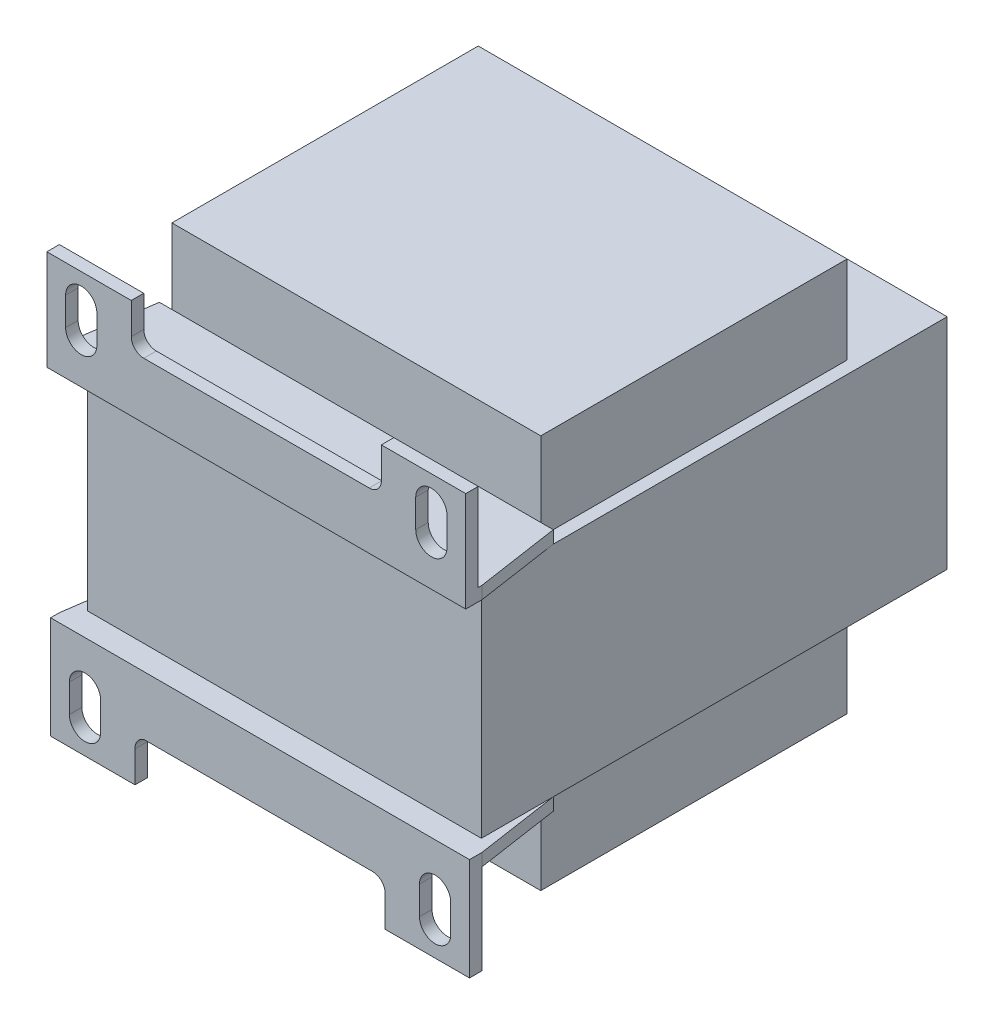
ISO-10303-21;
HEADER;
FILE_DESCRIPTION(('STEP AP214'),'2;1');
FILE_NAME('part.step','',(''),(''),'','','');
FILE_SCHEMA(('AUTOMOTIVE_DESIGN { 1 0 10303 214 1 1 1 1 }'));
ENDSEC;
DATA;
#1=APPLICATION_CONTEXT('core data for automotive mechanical design processes');
#2=APPLICATION_PROTOCOL_DEFINITION('international standard','automotive_design',2000,#1);
#3=PRODUCT_CONTEXT('',#1,'mechanical');
#4=PRODUCT('Part','Part','',(#3));
#5=PRODUCT_RELATED_PRODUCT_CATEGORY('part','',(#4));
#6=PRODUCT_DEFINITION_FORMATION('','',#4);
#7=PRODUCT_DEFINITION_CONTEXT('part definition',#1,'design');
#8=PRODUCT_DEFINITION('design','',#6,#7);
#9=PRODUCT_DEFINITION_SHAPE('','',#8);
#10=(LENGTH_UNIT() NAMED_UNIT(*) SI_UNIT(.MILLI.,.METRE.));
#11=(NAMED_UNIT(*) PLANE_ANGLE_UNIT() SI_UNIT($,.RADIAN.));
#12=(NAMED_UNIT(*) SI_UNIT($,.STERADIAN.) SOLID_ANGLE_UNIT());
#13=UNCERTAINTY_MEASURE_WITH_UNIT(LENGTH_MEASURE(1.E-05),#10,'distance_accuracy_value','');
#14=(GEOMETRIC_REPRESENTATION_CONTEXT(3) GLOBAL_UNCERTAINTY_ASSIGNED_CONTEXT((#13)) GLOBAL_UNIT_ASSIGNED_CONTEXT((#10,
#11,#12)) REPRESENTATION_CONTEXT('',''));
#15=CARTESIAN_POINT('',(0.,0.,0.));
#16=DIRECTION('',(0.,0.,1.));
#17=DIRECTION('',(1.,0.,0.));
#18=AXIS2_PLACEMENT_3D('',#15,#16,#17);
#19=CARTESIAN_POINT('',(0.,-8.84019607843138,0.));
#20=DIRECTION('',(0.,-1.,0.));
#21=DIRECTION('',(0.,0.,-1.));
#22=AXIS2_PLACEMENT_3D('',#19,#20,#21);
#23=PLANE('',#22);
#24=DIRECTION('',(0.14142135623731,0.,-0.989949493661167));
#25=VECTOR('',#24,1.);
#26=CARTESIAN_POINT('',(-14.1305510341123,-8.84019607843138,-2.01865014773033));
#27=LINE('',#26,#25);
#28=CARTESIAN_POINT('',(-25.4189296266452,-8.8401960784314,77.));
#29=VERTEX_POINT('',#28);
#30=CARTESIAN_POINT('',(-23.4189296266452,-8.84019607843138,63.));
#31=VERTEX_POINT('',#30);
#32=EDGE_CURVE('E410',#29,#31,#27,.T.);
#33=ORIENTED_EDGE('',*,*,#32,.F.);
#34=DIRECTION('',(0.,0.,-1.));
#35=VECTOR('',#34,1.);
#36=CARTESIAN_POINT('',(-25.4189296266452,-8.84019607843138,78.4));
#37=LINE('',#36,#35);
#38=CARTESIAN_POINT('',(-25.4189296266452,-8.84019607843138,78.4));
#39=VERTEX_POINT('',#38);
#40=EDGE_CURVE('E396',#39,#29,#37,.T.);
#41=ORIENTED_EDGE('',*,*,#40,.F.);
#42=DIRECTION('',(-1.,0.,0.));
#43=VECTOR('',#42,1.);
#44=CARTESIAN_POINT('',(39.5810703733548,-8.84019607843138,78.4));
#45=LINE('',#44,#43);
#46=CARTESIAN_POINT('',(41.5810703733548,-8.84019607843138,78.4));
#47=VERTEX_POINT('',#46);
#48=EDGE_CURVE('E734',#47,#39,#45,.T.);
#49=ORIENTED_EDGE('',*,*,#48,.F.);
#50=DIRECTION('',(0.,0.,1.));
#51=VECTOR('',#50,1.);
#52=CARTESIAN_POINT('',(41.5810703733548,-8.84019607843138,78.4));
#53=LINE('',#52,#51);
#54=CARTESIAN_POINT('',(41.5810703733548,-8.84019607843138,76.4));
#55=VERTEX_POINT('',#54);
#56=EDGE_CURVE('E606',#55,#47,#53,.T.);
#57=ORIENTED_EDGE('',*,*,#56,.F.);
#58=DIRECTION('',(0.147618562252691,0.,0.989044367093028));
#59=VECTOR('',#58,1.);
#60=CARTESIAN_POINT('',(29.5204674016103,-8.84019607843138,-4.40603991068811));
#61=LINE('',#60,#59);
#62=CARTESIAN_POINT('',(39.5810703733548,-8.84019607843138,63.));
#63=VERTEX_POINT('',#62);
#64=EDGE_CURVE('E446',#63,#55,#61,.T.);
#65=ORIENTED_EDGE('',*,*,#64,.F.);
#66=DIRECTION('',(0.,0.,1.));
#67=VECTOR('',#66,1.);
#68=CARTESIAN_POINT('',(39.5810703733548,-8.84019607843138,78.4));
#69=LINE('',#68,#67);
#70=CARTESIAN_POINT('',(39.5810703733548,-8.84019607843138,74.5));
#71=VERTEX_POINT('',#70);
#72=EDGE_CURVE('E599',#63,#71,#69,.T.);
#73=ORIENTED_EDGE('',*,*,#72,.T.);
#74=DIRECTION('',(1.,0.,0.));
#75=VECTOR('',#74,1.);
#76=CARTESIAN_POINT('',(-23.4189296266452,-8.84019607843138,74.5));
#77=LINE('',#76,#75);
#78=CARTESIAN_POINT('',(-23.4189296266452,-8.84019607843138,74.5));
#79=VERTEX_POINT('',#78);
#80=EDGE_CURVE('E628',#79,#71,#77,.T.);
#81=ORIENTED_EDGE('',*,*,#80,.F.);
#82=DIRECTION('',(0.,0.,-1.));
#83=VECTOR('',#82,1.);
#84=CARTESIAN_POINT('',(-23.4189296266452,-8.84019607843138,78.4));
#85=LINE('',#84,#83);
#86=EDGE_CURVE('E42',#79,#31,#85,.T.);
#87=ORIENTED_EDGE('',*,*,#86,.T.);
#88=EDGE_LOOP('',(#33,#41,#49,#57,#65,#73,#81,#87));
#89=FACE_BOUND('',#88,.T.);
#90=ADVANCED_FACE('F34',(#89),#23,.F.);
#91=CARTESIAN_POINT('',(39.5810703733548,-10.8401960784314,63.));
#92=DIRECTION('',(0.,1.,0.));
#93=DIRECTION('',(0.,0.,1.));
#94=AXIS2_PLACEMENT_3D('',#91,#92,#93);
#95=PLANE('',#94);
#96=DIRECTION('',(-0.14142135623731,0.,0.989949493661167));
#97=VECTOR('',#96,1.);
#98=CARTESIAN_POINT('',(-22.1589296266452,-10.8401960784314,54.18));
#99=LINE('',#98,#97);
#100=CARTESIAN_POINT('',(-23.4189296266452,-10.8401960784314,63.));
#101=VERTEX_POINT('',#100);
#102=CARTESIAN_POINT('',(-25.3332153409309,-10.8401960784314,76.4));
#103=VERTEX_POINT('',#102);
#104=EDGE_CURVE('E57',#101,#103,#99,.T.);
#105=ORIENTED_EDGE('',*,*,#104,.F.);
#106=DIRECTION('',(-1.,0.,0.));
#107=VECTOR('',#106,1.);
#108=CARTESIAN_POINT('',(39.5810703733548,-10.8401960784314,63.));
#109=LINE('',#108,#107);
#110=CARTESIAN_POINT('',(-21.4189296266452,-10.8401960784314,63.));
#111=VERTEX_POINT('',#110);
#112=EDGE_CURVE('E745',#111,#101,#109,.T.);
#113=ORIENTED_EDGE('',*,*,#112,.F.);
#114=CARTESIAN_POINT('',(37.5810703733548,-10.8401960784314,63.));
#115=VERTEX_POINT('',#114);
#116=EDGE_CURVE('E747',#115,#111,#109,.T.);
#117=ORIENTED_EDGE('',*,*,#116,.F.);
#118=CARTESIAN_POINT('',(39.5810703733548,-10.8401960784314,63.));
#119=VERTEX_POINT('',#118);
#120=EDGE_CURVE('E736',#119,#115,#109,.T.);
#121=ORIENTED_EDGE('',*,*,#120,.F.);
#122=DIRECTION('',(-0.147618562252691,0.,-0.989044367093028));
#123=VECTOR('',#122,1.);
#124=CARTESIAN_POINT('',(39.5810703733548,-10.8401960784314,63.));
#125=LINE('',#124,#123);
#126=CARTESIAN_POINT('',(41.5810703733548,-10.8401960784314,76.4));
#127=VERTEX_POINT('',#126);
#128=EDGE_CURVE('E443',#127,#119,#125,.T.);
#129=ORIENTED_EDGE('',*,*,#128,.F.);
#130=DIRECTION('',(-1.,0.,0.));
#131=VECTOR('',#130,1.);
#132=CARTESIAN_POINT('',(39.5810703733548,-10.8401960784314,76.4));
#133=LINE('',#132,#131);
#134=EDGE_CURVE('E742',#127,#103,#133,.T.);
#135=ORIENTED_EDGE('',*,*,#134,.T.);
#136=EDGE_LOOP('',(#105,#113,#117,#121,#129,#135));
#137=FACE_BOUND('',#136,.T.);
#138=ADVANCED_FACE('F873',(#137),#95,.F.);
#139=CARTESIAN_POINT('',(0.,26.1598039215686,0.));
#140=DIRECTION('',(0.,-1.,0.));
#141=DIRECTION('',(0.,0.,-1.));
#142=AXIS2_PLACEMENT_3D('',#139,#140,#141);
#143=PLANE('',#142);
#144=DIRECTION('',(0.,0.,1.));
#145=VECTOR('',#144,1.);
#146=CARTESIAN_POINT('',(-25.4189296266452,26.1598039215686,79.));
#147=LINE('',#146,#145);
#148=CARTESIAN_POINT('',(-25.4189296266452,26.1598039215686,77.));
#149=VERTEX_POINT('',#148);
#150=CARTESIAN_POINT('',(-25.4189296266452,26.1598039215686,79.));
#151=VERTEX_POINT('',#150);
#152=EDGE_CURVE('E579',#149,#151,#147,.T.);
#153=ORIENTED_EDGE('',*,*,#152,.F.);
#154=DIRECTION('',(0.14142135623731,0.,-0.989949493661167));
#155=VECTOR('',#154,1.);
#156=CARTESIAN_POINT('',(-14.1305510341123,26.1598039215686,-2.01865014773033));
#157=LINE('',#156,#155);
#158=CARTESIAN_POINT('',(-23.4189296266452,26.1598039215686,63.));
#159=VERTEX_POINT('',#158);
#160=EDGE_CURVE('E415',#149,#159,#157,.T.);
#161=ORIENTED_EDGE('',*,*,#160,.T.);
#162=DIRECTION('',(0.,0.,1.));
#163=VECTOR('',#162,1.);
#164=CARTESIAN_POINT('',(-23.4189296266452,26.1598039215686,79.));
#165=LINE('',#164,#163);
#166=CARTESIAN_POINT('',(-23.4189296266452,26.1598039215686,74.5));
#167=VERTEX_POINT('',#166);
#168=EDGE_CURVE('E565',#159,#167,#165,.T.);
#169=ORIENTED_EDGE('',*,*,#168,.T.);
#170=DIRECTION('',(-1.,0.,0.));
#171=VECTOR('',#170,1.);
#172=CARTESIAN_POINT('',(-23.4189296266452,26.1598039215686,74.5));
#173=LINE('',#172,#171);
#174=CARTESIAN_POINT('',(39.5810703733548,26.1598039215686,74.5));
#175=VERTEX_POINT('',#174);
#176=EDGE_CURVE('E627',#175,#167,#173,.T.);
#177=ORIENTED_EDGE('',*,*,#176,.F.);
#178=DIRECTION('',(0.,0.,-1.));
#179=VECTOR('',#178,1.);
#180=CARTESIAN_POINT('',(39.5810703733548,26.1598039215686,63.));
#181=LINE('',#180,#179);
#182=CARTESIAN_POINT('',(39.5810703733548,26.1598039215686,63.));
#183=VERTEX_POINT('',#182);
#184=EDGE_CURVE('E581',#175,#183,#181,.T.);
#185=ORIENTED_EDGE('',*,*,#184,.T.);
#186=DIRECTION('',(0.147618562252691,0.,0.989044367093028));
#187=VECTOR('',#186,1.);
#188=CARTESIAN_POINT('',(29.5204674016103,26.1598039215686,-4.40603991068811));
#189=LINE('',#188,#187);
#190=CARTESIAN_POINT('',(41.5810703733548,26.1598039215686,76.4));
#191=VERTEX_POINT('',#190);
#192=EDGE_CURVE('E441',#183,#191,#189,.T.);
#193=ORIENTED_EDGE('',*,*,#192,.T.);
#194=DIRECTION('',(0.,0.,-1.));
#195=VECTOR('',#194,1.);
#196=CARTESIAN_POINT('',(41.5810703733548,26.1598039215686,63.));
#197=LINE('',#196,#195);
#198=CARTESIAN_POINT('',(41.5810703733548,26.1598039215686,79.));
#199=VERTEX_POINT('',#198);
#200=EDGE_CURVE('E590',#199,#191,#197,.T.);
#201=ORIENTED_EDGE('',*,*,#200,.F.);
#202=DIRECTION('',(1.,0.,0.));
#203=VECTOR('',#202,1.);
#204=CARTESIAN_POINT('',(-23.4189296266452,26.1598039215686,79.));
#205=LINE('',#204,#203);
#206=EDGE_CURVE('E593',#151,#199,#205,.T.);
#207=ORIENTED_EDGE('',*,*,#206,.F.);
#208=EDGE_LOOP('',(#153,#161,#169,#177,#185,#193,#201,#207));
#209=FACE_BOUND('',#208,.T.);
#210=ADVANCED_FACE('F899',(#209),#143,.T.);
#211=CARTESIAN_POINT('',(41.5810703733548,28.1598039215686,77.));
#212=DIRECTION('',(0.,-1.,0.));
#213=DIRECTION('',(0.,0.,-1.));
#214=AXIS2_PLACEMENT_3D('',#211,#212,#213);
#215=PLANE('',#214);
#216=DIRECTION('',(0.14142135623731,0.,-0.989949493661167));
#217=VECTOR('',#216,1.);
#218=CARTESIAN_POINT('',(-24.0789296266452,28.1598039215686,67.62));
#219=LINE('',#218,#217);
#220=CARTESIAN_POINT('',(-25.4189296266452,28.1598039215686,77.));
#221=VERTEX_POINT('',#220);
#222=CARTESIAN_POINT('',(-23.4189296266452,28.1598039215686,63.));
#223=VERTEX_POINT('',#222);
#224=EDGE_CURVE('E431',#221,#223,#219,.T.);
#225=ORIENTED_EDGE('',*,*,#224,.F.);
#226=DIRECTION('',(-1.,0.,0.));
#227=VECTOR('',#226,1.);
#228=CARTESIAN_POINT('',(41.5810703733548,28.1598039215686,77.));
#229=LINE('',#228,#227);
#230=CARTESIAN_POINT('',(41.5810703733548,28.1598039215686,77.));
#231=VERTEX_POINT('',#230);
#232=EDGE_CURVE('E567',#231,#221,#229,.T.);
#233=ORIENTED_EDGE('',*,*,#232,.F.);
#234=DIRECTION('',(0.,0.,1.));
#235=VECTOR('',#234,1.);
#236=CARTESIAN_POINT('',(41.5810703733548,28.1598039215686,77.));
#237=LINE('',#236,#235);
#238=CARTESIAN_POINT('',(41.5810703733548,28.1598039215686,76.4));
#239=VERTEX_POINT('',#238);
#240=EDGE_CURVE('E554',#239,#231,#237,.T.);
#241=ORIENTED_EDGE('',*,*,#240,.F.);
#242=DIRECTION('',(0.147618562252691,0.,0.989044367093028));
#243=VECTOR('',#242,1.);
#244=CARTESIAN_POINT('',(41.6686711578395,28.1598039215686,76.9869252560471));
#245=LINE('',#244,#243);
#246=CARTESIAN_POINT('',(39.5810703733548,28.1598039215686,63.));
#247=VERTEX_POINT('',#246);
#248=EDGE_CURVE('E11',#247,#239,#245,.T.);
#249=ORIENTED_EDGE('',*,*,#248,.F.);
#250=DIRECTION('',(-1.,0.,0.));
#251=VECTOR('',#250,1.);
#252=CARTESIAN_POINT('',(41.5810703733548,28.1598039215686,63.));
#253=LINE('',#252,#251);
#254=CARTESIAN_POINT('',(37.5810703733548,28.1598039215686,63.));
#255=VERTEX_POINT('',#254);
#256=EDGE_CURVE('E570',#247,#255,#253,.T.);
#257=ORIENTED_EDGE('',*,*,#256,.T.);
#258=CARTESIAN_POINT('',(-21.4189296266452,28.1598039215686,63.));
#259=VERTEX_POINT('',#258);
#260=EDGE_CURVE('E572',#255,#259,#253,.T.);
#261=ORIENTED_EDGE('',*,*,#260,.T.);
#262=EDGE_CURVE('E559',#259,#223,#253,.T.);
#263=ORIENTED_EDGE('',*,*,#262,.T.);
#264=EDGE_LOOP('',(#225,#233,#241,#249,#257,#261,#263));
#265=FACE_BOUND('',#264,.T.);
#266=ADVANCED_FACE('F907',(#265),#215,.F.);
#267=CARTESIAN_POINT('',(-23.4189296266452,42.1598039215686,63.));
#268=DIRECTION('',(0.,0.,1.));
#269=DIRECTION('',(1.,0.,0.));
#270=AXIS2_PLACEMENT_3D('',#267,#268,#269);
#271=PLANE('',#270);
#272=DIRECTION('',(0.,1.,0.));
#273=VECTOR('',#272,1.);
#274=CARTESIAN_POINT('',(-23.4189296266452,-174.568956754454,63.));
#275=LINE('',#274,#273);
#276=EDGE_CURVE('E49',#159,#223,#275,.T.);
#277=ORIENTED_EDGE('',*,*,#276,.T.);
#278=ORIENTED_EDGE('',*,*,#262,.F.);
#279=DIRECTION('',(0.,-1.,0.));
#280=VECTOR('',#279,1.);
#281=CARTESIAN_POINT('',(-21.4189296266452,40.1598039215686,63.));
#282=LINE('',#281,#280);
#283=CARTESIAN_POINT('',(-21.4189296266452,26.1598039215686,63.));
#284=VERTEX_POINT('',#283);
#285=EDGE_CURVE('E665',#259,#284,#282,.T.);
#286=ORIENTED_EDGE('',*,*,#285,.T.);
#287=DIRECTION('',(-1.,0.,0.));
#288=VECTOR('',#287,1.);
#289=CARTESIAN_POINT('',(-23.4189296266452,26.1598039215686,63.));
#290=LINE('',#289,#288);
#291=EDGE_CURVE('E602',#284,#159,#290,.T.);
#292=ORIENTED_EDGE('',*,*,#291,.T.);
#293=EDGE_LOOP('',(#277,#278,#286,#292));
#294=FACE_BOUND('',#293,.T.);
#295=ADVANCED_FACE('F912',(#294),#271,.F.);
#296=CARTESIAN_POINT('',(39.5810703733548,-25.2401960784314,63.));
#297=DIRECTION('',(0.,0.,1.));
#298=DIRECTION('',(1.,0.,0.));
#299=AXIS2_PLACEMENT_3D('',#296,#297,#298);
#300=PLANE('',#299);
#301=EDGE_CURVE('E426',#101,#31,#275,.T.);
#302=ORIENTED_EDGE('',*,*,#301,.T.);
#303=DIRECTION('',(1.,0.,0.));
#304=VECTOR('',#303,1.);
#305=CARTESIAN_POINT('',(39.5810703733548,-8.84019607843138,63.));
#306=LINE('',#305,#304);
#307=CARTESIAN_POINT('',(-21.4189296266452,-8.84019607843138,63.));
#308=VERTEX_POINT('',#307);
#309=EDGE_CURVE('E729',#31,#308,#306,.T.);
#310=ORIENTED_EDGE('',*,*,#309,.T.);
#311=DIRECTION('',(0.,1.,0.));
#312=VECTOR('',#311,1.);
#313=CARTESIAN_POINT('',(-21.4189296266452,-22.8401960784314,63.));
#314=LINE('',#313,#312);
#315=EDGE_CURVE('E702',#111,#308,#314,.T.);
#316=ORIENTED_EDGE('',*,*,#315,.F.);
#317=ORIENTED_EDGE('',*,*,#112,.T.);
#318=EDGE_LOOP('',(#302,#310,#316,#317));
#319=FACE_BOUND('',#318,.T.);
#320=ADVANCED_FACE('F1000',(#319),#300,.F.);
#321=CARTESIAN_POINT('',(0.,-25.2401960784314,0.));
#322=DIRECTION('',(0.,-1.,0.));
#323=DIRECTION('',(0.,0.,-1.));
#324=AXIS2_PLACEMENT_3D('',#321,#322,#323);
#325=PLANE('',#324);
#326=DIRECTION('',(0.,0.,1.));
#327=VECTOR('',#326,1.);
#328=CARTESIAN_POINT('',(-25.4189296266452,-25.2401960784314,76.4));
#329=LINE('',#328,#327);
#330=CARTESIAN_POINT('',(-25.4189296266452,-25.2401960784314,77.));
#331=VERTEX_POINT('',#330);
#332=CARTESIAN_POINT('',(-25.4189296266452,-25.2401960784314,78.4));
#333=VERTEX_POINT('',#332);
#334=EDGE_CURVE('E616',#331,#333,#329,.T.);
#335=ORIENTED_EDGE('',*,*,#334,.F.);
#336=DIRECTION('',(0.14142135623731,0.,-0.989949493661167));
#337=VECTOR('',#336,1.);
#338=CARTESIAN_POINT('',(-14.1305510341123,-25.2401960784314,-2.01865014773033));
#339=LINE('',#338,#337);
#340=CARTESIAN_POINT('',(-25.3332153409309,-25.2401960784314,76.4));
#341=VERTEX_POINT('',#340);
#342=EDGE_CURVE('E420',#331,#341,#339,.T.);
#343=ORIENTED_EDGE('',*,*,#342,.T.);
#344=DIRECTION('',(-1.,0.,0.));
#345=VECTOR('',#344,1.);
#346=CARTESIAN_POINT('',(39.5810703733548,-25.2401960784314,76.4));
#347=LINE('',#346,#345);
#348=CARTESIAN_POINT('',(-11.9189296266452,-25.2401960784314,76.4));
#349=VERTEX_POINT('',#348);
#350=EDGE_CURVE('E743',#349,#341,#347,.T.);
#351=ORIENTED_EDGE('',*,*,#350,.F.);
#352=DIRECTION('',(0.,0.,-1.));
#353=VECTOR('',#352,1.);
#354=CARTESIAN_POINT('',(-11.9189296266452,-25.2401960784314,78.4));
#355=LINE('',#354,#353);
#356=CARTESIAN_POINT('',(-11.9189296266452,-25.2401960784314,78.4));
#357=VERTEX_POINT('',#356);
#358=EDGE_CURVE('E792',#357,#349,#355,.T.);
#359=ORIENTED_EDGE('',*,*,#358,.F.);
#360=DIRECTION('',(-1.,0.,0.));
#361=VECTOR('',#360,1.);
#362=CARTESIAN_POINT('',(39.5810703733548,-25.2401960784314,78.4));
#363=LINE('',#362,#361);
#364=EDGE_CURVE('E732',#357,#333,#363,.T.);
#365=ORIENTED_EDGE('',*,*,#364,.T.);
#366=EDGE_LOOP('',(#335,#343,#351,#359,#365));
#367=FACE_BOUND('',#366,.T.);
#368=ADVANCED_FACE('F854',(#367),#325,.T.);
#369=CARTESIAN_POINT('',(39.5810703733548,-25.2401960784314,76.4));
#370=DIRECTION('',(0.,0.,1.));
#371=DIRECTION('',(1.,0.,0.));
#372=AXIS2_PLACEMENT_3D('',#369,#370,#371);
#373=PLANE('',#372);
#374=CARTESIAN_POINT('',(36.0810703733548,-20.7401960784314,76.4));
#375=DIRECTION('',(0.,0.,-1.));
#376=DIRECTION('',(-1.,0.,0.));
#377=AXIS2_PLACEMENT_3D('',#374,#375,#376);
#378=CIRCLE('',#377,2.5);
#379=CARTESIAN_POINT('',(38.5810703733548,-20.7401960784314,76.4));
#380=VERTEX_POINT('',#379);
#381=CARTESIAN_POINT('',(33.5810703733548,-20.7401960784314,76.4));
#382=VERTEX_POINT('',#381);
#383=EDGE_CURVE('E765',#380,#382,#378,.T.);
#384=ORIENTED_EDGE('',*,*,#383,.F.);
#385=DIRECTION('',(0.,-1.,0.));
#386=VECTOR('',#385,1.);
#387=CARTESIAN_POINT('',(38.5810703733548,0.,76.4));
#388=LINE('',#387,#386);
#389=CARTESIAN_POINT('',(38.5810703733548,-16.2401960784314,76.4));
#390=VERTEX_POINT('',#389);
#391=EDGE_CURVE('E768',#390,#380,#388,.T.);
#392=ORIENTED_EDGE('',*,*,#391,.F.);
#393=CARTESIAN_POINT('',(36.0810703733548,-16.2401960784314,76.4));
#394=DIRECTION('',(0.,0.,-1.));
#395=DIRECTION('',(-1.,0.,0.));
#396=AXIS2_PLACEMENT_3D('',#393,#394,#395);
#397=CIRCLE('',#396,2.5);
#398=CARTESIAN_POINT('',(33.5810703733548,-16.2401960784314,76.4));
#399=VERTEX_POINT('',#398);
#400=EDGE_CURVE('E758',#399,#390,#397,.T.);
#401=ORIENTED_EDGE('',*,*,#400,.F.);
#402=DIRECTION('',(0.,-1.,0.));
#403=VECTOR('',#402,1.);
#404=CARTESIAN_POINT('',(33.5810703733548,0.,76.4));
#405=LINE('',#404,#403);
#406=EDGE_CURVE('E762',#399,#382,#405,.T.);
#407=ORIENTED_EDGE('',*,*,#406,.T.);
#408=EDGE_LOOP('',(#384,#392,#401,#407));
#409=FACE_BOUND('',#408,.T.);
#410=CARTESIAN_POINT('',(-19.9189296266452,-20.7401960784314,76.4));
#411=DIRECTION('',(0.,0.,-1.));
#412=DIRECTION('',(-1.,0.,0.));
#413=AXIS2_PLACEMENT_3D('',#410,#411,#412);
#414=CIRCLE('',#413,2.50000000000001);
#415=CARTESIAN_POINT('',(-17.4189296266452,-20.7401960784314,76.4));
#416=VERTEX_POINT('',#415);
#417=CARTESIAN_POINT('',(-22.4189296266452,-20.7401960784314,76.4));
#418=VERTEX_POINT('',#417);
#419=EDGE_CURVE('E837',#416,#418,#414,.T.);
#420=ORIENTED_EDGE('',*,*,#419,.F.);
#421=DIRECTION('',(0.,-1.,0.));
#422=VECTOR('',#421,1.);
#423=CARTESIAN_POINT('',(-17.4189296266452,0.,76.4));
#424=LINE('',#423,#422);
#425=CARTESIAN_POINT('',(-17.4189296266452,-16.2401960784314,76.4));
#426=VERTEX_POINT('',#425);
#427=EDGE_CURVE('E406',#426,#416,#424,.T.);
#428=ORIENTED_EDGE('',*,*,#427,.F.);
#429=CARTESIAN_POINT('',(-19.9189296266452,-16.2401960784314,76.4));
#430=DIRECTION('',(0.,0.,-1.));
#431=DIRECTION('',(-1.,0.,0.));
#432=AXIS2_PLACEMENT_3D('',#429,#430,#431);
#433=CIRCLE('',#432,2.50000000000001);
#434=CARTESIAN_POINT('',(-22.4189296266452,-16.2401960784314,76.4));
#435=VERTEX_POINT('',#434);
#436=EDGE_CURVE('E830',#435,#426,#433,.T.);
#437=ORIENTED_EDGE('',*,*,#436,.F.);
#438=DIRECTION('',(0.,-1.,0.));
#439=VECTOR('',#438,1.);
#440=CARTESIAN_POINT('',(-22.4189296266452,0.,76.4));
#441=LINE('',#440,#439);
#442=EDGE_CURVE('E834',#435,#418,#441,.T.);
#443=ORIENTED_EDGE('',*,*,#442,.T.);
#444=EDGE_LOOP('',(#420,#428,#437,#443));
#445=FACE_BOUND('',#444,.T.);
#446=DIRECTION('',(0.,-1.,0.));
#447=VECTOR('',#446,1.);
#448=CARTESIAN_POINT('',(-25.3332153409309,-25.2401960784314,76.4));
#449=LINE('',#448,#447);
#450=EDGE_CURVE('E421',#103,#341,#449,.T.);
#451=ORIENTED_EDGE('',*,*,#450,.F.);
#452=ORIENTED_EDGE('',*,*,#134,.F.);
#453=DIRECTION('',(0.,1.,0.));
#454=VECTOR('',#453,1.);
#455=CARTESIAN_POINT('',(41.5810703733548,-10.8401960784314,76.4));
#456=LINE('',#455,#454);
#457=CARTESIAN_POINT('',(41.5810703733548,-25.2401960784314,76.4));
#458=VERTEX_POINT('',#457);
#459=EDGE_CURVE('E614',#458,#127,#456,.T.);
#460=ORIENTED_EDGE('',*,*,#459,.F.);
#461=CARTESIAN_POINT('',(28.0810703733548,-25.2401960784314,76.4));
#462=VERTEX_POINT('',#461);
#463=EDGE_CURVE('E739',#458,#462,#347,.T.);
#464=ORIENTED_EDGE('',*,*,#463,.T.);
#465=DIRECTION('',(0.,1.,0.));
#466=VECTOR('',#465,1.);
#467=CARTESIAN_POINT('',(28.0810703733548,0.,76.4));
#468=LINE('',#467,#466);
#469=CARTESIAN_POINT('',(28.0810703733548,-20.2401960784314,76.4));
#470=VERTEX_POINT('',#469);
#471=EDGE_CURVE('E799',#462,#470,#468,.T.);
#472=ORIENTED_EDGE('',*,*,#471,.T.);
#473=CARTESIAN_POINT('',(26.0810703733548,-20.2401960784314,76.4));
#474=DIRECTION('',(0.,0.,-1.));
#475=DIRECTION('',(-1.,0.,0.));
#476=AXIS2_PLACEMENT_3D('',#473,#474,#475);
#477=CIRCLE('',#476,2.00000000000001);
#478=CARTESIAN_POINT('',(26.0810703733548,-18.2401960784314,76.4));
#479=VERTEX_POINT('',#478);
#480=EDGE_CURVE('E802',#470,#479,#477,.F.);
#481=ORIENTED_EDGE('',*,*,#480,.T.);
#482=DIRECTION('',(-1.,0.,0.));
#483=VECTOR('',#482,1.);
#484=CARTESIAN_POINT('',(0.,-18.2401960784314,76.4));
#485=LINE('',#484,#483);
#486=CARTESIAN_POINT('',(-10.4775964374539,-18.2401960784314,76.4));
#487=VERTEX_POINT('',#486);
#488=EDGE_CURVE('E805',#479,#487,#485,.T.);
#489=ORIENTED_EDGE('',*,*,#488,.T.);
#490=CARTESIAN_POINT('',(-9.92049667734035,-20.1610396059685,76.4));
#491=DIRECTION('',(0.,0.,-1.));
#492=DIRECTION('',(-1.,0.,0.));
#493=AXIS2_PLACEMENT_3D('',#490,#491,#492);
#494=CIRCLE('',#493,2.);
#495=CARTESIAN_POINT('',(-11.9189296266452,-20.2401960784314,76.4));
#496=VERTEX_POINT('',#495);
#497=EDGE_CURVE('E808',#487,#496,#494,.F.);
#498=ORIENTED_EDGE('',*,*,#497,.T.);
#499=DIRECTION('',(0.,1.,0.));
#500=VECTOR('',#499,1.);
#501=CARTESIAN_POINT('',(-11.9189296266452,0.,76.4));
#502=LINE('',#501,#500);
#503=EDGE_CURVE('E795',#349,#496,#502,.T.);
#504=ORIENTED_EDGE('',*,*,#503,.F.);
#505=ORIENTED_EDGE('',*,*,#350,.T.);
#506=EDGE_LOOP('',(#451,#452,#460,#464,#472,#481,#489,#498,#504,#505));
#507=FACE_BOUND('',#506,.T.);
#508=ADVANCED_FACE('F1050',(#409,#445,#507),#373,.F.);
#509=CARTESIAN_POINT('',(-25.4189296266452,0.,0.));
#510=DIRECTION('',(1.,0.,0.));
#511=DIRECTION('',(0.,0.,-1.));
#512=AXIS2_PLACEMENT_3D('',#509,#510,#511);
#513=PLANE('',#512);
#514=DIRECTION('',(0.,1.,0.));
#515=VECTOR('',#514,1.);
#516=CARTESIAN_POINT('',(-25.4189296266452,-174.568956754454,77.));
#517=LINE('',#516,#515);
#518=EDGE_CURVE('E400',#331,#29,#517,.T.);
#519=ORIENTED_EDGE('',*,*,#518,.F.);
#520=ORIENTED_EDGE('',*,*,#334,.T.);
#521=DIRECTION('',(0.,1.,0.));
#522=VECTOR('',#521,1.);
#523=CARTESIAN_POINT('',(-25.4189296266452,-25.2401960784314,78.4));
#524=LINE('',#523,#522);
#525=EDGE_CURVE('E403',#333,#39,#524,.T.);
#526=ORIENTED_EDGE('',*,*,#525,.T.);
#527=ORIENTED_EDGE('',*,*,#40,.T.);
#528=EDGE_LOOP('',(#519,#520,#526,#527));
#529=FACE_BOUND('',#528,.T.);
#530=ADVANCED_FACE('F398',(#529),#513,.F.);
#531=CARTESIAN_POINT('',(-25.4189296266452,0.,0.));
#532=DIRECTION('',(1.,0.,0.));
#533=DIRECTION('',(0.,0.,-1.));
#534=AXIS2_PLACEMENT_3D('',#531,#532,#533);
#535=PLANE('',#534);
#536=EDGE_CURVE('E422',#149,#221,#517,.T.);
#537=ORIENTED_EDGE('',*,*,#536,.F.);
#538=ORIENTED_EDGE('',*,*,#152,.T.);
#539=DIRECTION('',(0.,1.,0.));
#540=VECTOR('',#539,1.);
#541=CARTESIAN_POINT('',(-25.4189296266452,42.1598039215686,79.));
#542=LINE('',#541,#540);
#543=CARTESIAN_POINT('',(-25.4189296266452,42.1598039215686,79.));
#544=VERTEX_POINT('',#543);
#545=EDGE_CURVE('E573',#151,#544,#542,.T.);
#546=ORIENTED_EDGE('',*,*,#545,.T.);
#547=DIRECTION('',(0.,0.,-1.));
#548=VECTOR('',#547,1.);
#549=CARTESIAN_POINT('',(-25.4189296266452,42.1598039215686,79.));
#550=LINE('',#549,#548);
#551=CARTESIAN_POINT('',(-25.4189296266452,42.1598039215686,77.));
#552=VERTEX_POINT('',#551);
#553=EDGE_CURVE('E576',#544,#552,#550,.T.);
#554=ORIENTED_EDGE('',*,*,#553,.T.);
#555=DIRECTION('',(0.,1.,0.));
#556=VECTOR('',#555,1.);
#557=CARTESIAN_POINT('',(-25.4189296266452,42.1598039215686,77.));
#558=LINE('',#557,#556);
#559=EDGE_CURVE('E542',#221,#552,#558,.T.);
#560=ORIENTED_EDGE('',*,*,#559,.F.);
#561=EDGE_LOOP('',(#537,#538,#546,#554,#560));
#562=FACE_BOUND('',#561,.T.);
#563=ADVANCED_FACE('F950',(#562),#535,.F.);
#564=DIRECTION('',(0.,-1.,0.));
#565=VECTOR('',#564,1.);
#566=CARTESIAN_POINT('',(39.5810703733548,209.388564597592,63.));
#567=LINE('',#566,#565);
#568=EDGE_CURVE('E414',#63,#119,#567,.T.);
#569=ORIENTED_EDGE('',*,*,#568,.T.);
#570=ORIENTED_EDGE('',*,*,#120,.T.);
#571=DIRECTION('',(0.,1.,0.));
#572=VECTOR('',#571,1.);
#573=CARTESIAN_POINT('',(37.5810703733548,-22.8401960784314,63.));
#574=LINE('',#573,#572);
#575=CARTESIAN_POINT('',(37.5810703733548,-8.84019607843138,63.));
#576=VERTEX_POINT('',#575);
#577=EDGE_CURVE('E698',#115,#576,#574,.T.);
#578=ORIENTED_EDGE('',*,*,#577,.T.);
#579=EDGE_CURVE('E733',#576,#63,#306,.T.);
#580=ORIENTED_EDGE('',*,*,#579,.T.);
#581=EDGE_LOOP('',(#569,#570,#578,#580));
#582=FACE_BOUND('',#581,.T.);
#583=ADVANCED_FACE('F869',(#582),#300,.F.);
#584=CARTESIAN_POINT('',(41.5810703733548,0.,0.));
#585=DIRECTION('',(-1.,0.,0.));
#586=DIRECTION('',(0.,0.,1.));
#587=AXIS2_PLACEMENT_3D('',#584,#585,#586);
#588=PLANE('',#587);
#589=DIRECTION('',(0.,-1.,0.));
#590=VECTOR('',#589,1.);
#591=CARTESIAN_POINT('',(41.5810703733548,209.388564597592,76.4));
#592=LINE('',#591,#590);
#593=EDGE_CURVE('E435',#55,#127,#592,.T.);
#594=ORIENTED_EDGE('',*,*,#593,.F.);
#595=ORIENTED_EDGE('',*,*,#56,.T.);
#596=DIRECTION('',(0.,-1.,0.));
#597=VECTOR('',#596,1.);
#598=CARTESIAN_POINT('',(41.5810703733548,-25.2401960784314,78.4));
#599=LINE('',#598,#597);
#600=CARTESIAN_POINT('',(41.5810703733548,-25.2401960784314,78.4));
#601=VERTEX_POINT('',#600);
#602=EDGE_CURVE('E608',#47,#601,#599,.T.);
#603=ORIENTED_EDGE('',*,*,#602,.T.);
#604=DIRECTION('',(0.,0.,-1.));
#605=VECTOR('',#604,1.);
#606=CARTESIAN_POINT('',(41.5810703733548,-25.2401960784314,76.4));
#607=LINE('',#606,#605);
#608=EDGE_CURVE('E611',#601,#458,#607,.T.);
#609=ORIENTED_EDGE('',*,*,#608,.T.);
#610=ORIENTED_EDGE('',*,*,#459,.T.);
#611=EDGE_LOOP('',(#594,#595,#603,#609,#610));
#612=FACE_BOUND('',#611,.T.);
#613=ADVANCED_FACE('F1120',(#612),#588,.F.);
#614=EDGE_CURVE('E439',#247,#183,#567,.T.);
#615=ORIENTED_EDGE('',*,*,#614,.T.);
#616=CARTESIAN_POINT('',(37.5810703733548,26.1598039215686,63.));
#617=VERTEX_POINT('',#616);
#618=EDGE_CURVE('E603',#183,#617,#290,.T.);
#619=ORIENTED_EDGE('',*,*,#618,.T.);
#620=DIRECTION('',(0.,-1.,0.));
#621=VECTOR('',#620,1.);
#622=CARTESIAN_POINT('',(37.5810703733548,40.1598039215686,63.));
#623=LINE('',#622,#621);
#624=EDGE_CURVE('E669',#255,#617,#623,.T.);
#625=ORIENTED_EDGE('',*,*,#624,.F.);
#626=ORIENTED_EDGE('',*,*,#256,.F.);
#627=EDGE_LOOP('',(#615,#619,#625,#626));
#628=FACE_BOUND('',#627,.T.);
#629=ADVANCED_FACE('F986',(#628),#271,.F.);
#630=CARTESIAN_POINT('',(41.5810703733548,0.,0.));
#631=DIRECTION('',(-1.,0.,0.));
#632=DIRECTION('',(0.,0.,1.));
#633=AXIS2_PLACEMENT_3D('',#630,#631,#632);
#634=PLANE('',#633);
#635=EDGE_CURVE('E438',#239,#191,#592,.T.);
#636=ORIENTED_EDGE('',*,*,#635,.F.);
#637=ORIENTED_EDGE('',*,*,#240,.T.);
#638=DIRECTION('',(0.,1.,0.));
#639=VECTOR('',#638,1.);
#640=CARTESIAN_POINT('',(41.5810703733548,42.1598039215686,77.));
#641=LINE('',#640,#639);
#642=CARTESIAN_POINT('',(41.5810703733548,42.1598039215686,77.));
#643=VERTEX_POINT('',#642);
#644=EDGE_CURVE('E556',#231,#643,#641,.T.);
#645=ORIENTED_EDGE('',*,*,#644,.T.);
#646=DIRECTION('',(0.,0.,1.));
#647=VECTOR('',#646,1.);
#648=CARTESIAN_POINT('',(41.5810703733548,42.1598039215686,63.));
#649=LINE('',#648,#647);
#650=CARTESIAN_POINT('',(41.5810703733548,42.1598039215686,79.));
#651=VERTEX_POINT('',#650);
#652=EDGE_CURVE('E584',#643,#651,#649,.T.);
#653=ORIENTED_EDGE('',*,*,#652,.T.);
#654=DIRECTION('',(0.,-1.,0.));
#655=VECTOR('',#654,1.);
#656=CARTESIAN_POINT('',(41.5810703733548,42.1598039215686,79.));
#657=LINE('',#656,#655);
#658=EDGE_CURVE('E587',#651,#199,#657,.T.);
#659=ORIENTED_EDGE('',*,*,#658,.T.);
#660=ORIENTED_EDGE('',*,*,#200,.T.);
#661=EDGE_LOOP('',(#636,#637,#645,#653,#659,#660));
#662=FACE_BOUND('',#661,.T.);
#663=ADVANCED_FACE('F941',(#662),#634,.F.);
#664=CARTESIAN_POINT('',(0.,42.1598039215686,0.));
#665=DIRECTION('',(0.,-1.,0.));
#666=DIRECTION('',(0.,0.,-1.));
#667=AXIS2_PLACEMENT_3D('',#664,#665,#666);
#668=PLANE('',#667);
#669=DIRECTION('',(0.,0.,-1.));
#670=VECTOR('',#669,1.);
#671=CARTESIAN_POINT('',(-11.9189296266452,42.1598039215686,79.));
#672=LINE('',#671,#670);
#673=CARTESIAN_POINT('',(-11.9189296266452,42.1598039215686,79.));
#674=VERTEX_POINT('',#673);
#675=CARTESIAN_POINT('',(-11.9189296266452,42.1598039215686,77.));
#676=VERTEX_POINT('',#675);
#677=EDGE_CURVE('E543',#674,#676,#672,.T.);
#678=ORIENTED_EDGE('',*,*,#677,.T.);
#679=DIRECTION('',(-1.,0.,0.));
#680=VECTOR('',#679,1.);
#681=CARTESIAN_POINT('',(41.5810703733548,42.1598039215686,77.));
#682=LINE('',#681,#680);
#683=EDGE_CURVE('E566',#676,#552,#682,.T.);
#684=ORIENTED_EDGE('',*,*,#683,.T.);
#685=ORIENTED_EDGE('',*,*,#553,.F.);
#686=DIRECTION('',(1.,0.,0.));
#687=VECTOR('',#686,1.);
#688=CARTESIAN_POINT('',(-23.4189296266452,42.1598039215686,79.));
#689=LINE('',#688,#687);
#690=EDGE_CURVE('E596',#544,#674,#689,.T.);
#691=ORIENTED_EDGE('',*,*,#690,.T.);
#692=EDGE_LOOP('',(#678,#684,#685,#691));
#693=FACE_BOUND('',#692,.T.);
#694=ADVANCED_FACE('F979',(#693),#668,.F.);
#695=CARTESIAN_POINT('',(-23.4189296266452,26.1598039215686,74.5));
#696=DIRECTION('',(1.,0.,0.));
#697=DIRECTION('',(0.,0.,-1.));
#698=AXIS2_PLACEMENT_3D('',#695,#696,#697);
#699=PLANE('',#698);
#700=DIRECTION('',(0.,0.,-1.));
#701=VECTOR('',#700,1.);
#702=CARTESIAN_POINT('',(-23.4189296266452,-8.84019607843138,74.5));
#703=LINE('',#702,#701);
#704=CARTESIAN_POINT('',(-23.4189296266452,-8.84019607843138,0.));
#705=VERTEX_POINT('',#704);
#706=EDGE_CURVE('E643',#31,#705,#703,.T.);
#707=ORIENTED_EDGE('',*,*,#706,.F.);
#708=ORIENTED_EDGE('',*,*,#86,.F.);
#709=DIRECTION('',(0.,-1.,0.));
#710=VECTOR('',#709,1.);
#711=CARTESIAN_POINT('',(-23.4189296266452,26.1598039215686,74.5));
#712=LINE('',#711,#710);
#713=EDGE_CURVE('E635',#167,#79,#712,.T.);
#714=ORIENTED_EDGE('',*,*,#713,.F.);
#715=ORIENTED_EDGE('',*,*,#168,.F.);
#716=DIRECTION('',(0.,0.,-1.));
#717=VECTOR('',#716,1.);
#718=CARTESIAN_POINT('',(-23.4189296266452,26.1598039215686,74.5));
#719=LINE('',#718,#717);
#720=CARTESIAN_POINT('',(-23.4189296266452,26.1598039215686,0.));
#721=VERTEX_POINT('',#720);
#722=EDGE_CURVE('E633',#159,#721,#719,.T.);
#723=ORIENTED_EDGE('',*,*,#722,.T.);
#724=DIRECTION('',(0.,-1.,0.));
#725=VECTOR('',#724,1.);
#726=CARTESIAN_POINT('',(-23.4189296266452,26.1598039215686,0.));
#727=LINE('',#726,#725);
#728=EDGE_CURVE('E660',#721,#705,#727,.T.);
#729=ORIENTED_EDGE('',*,*,#728,.T.);
#730=EDGE_LOOP('',(#707,#708,#714,#715,#723,#729));
#731=FACE_BOUND('',#730,.T.);
#732=ADVANCED_FACE('F36',(#731),#699,.F.);
#733=CARTESIAN_POINT('',(39.5810703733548,26.1598039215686,74.5));
#734=DIRECTION('',(-1.,0.,0.));
#735=DIRECTION('',(0.,0.,1.));
#736=AXIS2_PLACEMENT_3D('',#733,#734,#735);
#737=PLANE('',#736);
#738=DIRECTION('',(0.,0.,-1.));
#739=VECTOR('',#738,1.);
#740=CARTESIAN_POINT('',(39.5810703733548,26.1598039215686,74.5));
#741=LINE('',#740,#739);
#742=CARTESIAN_POINT('',(39.5810703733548,26.1598039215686,0.));
#743=VERTEX_POINT('',#742);
#744=EDGE_CURVE('E649',#183,#743,#741,.T.);
#745=ORIENTED_EDGE('',*,*,#744,.F.);
#746=ORIENTED_EDGE('',*,*,#184,.F.);
#747=DIRECTION('',(0.,1.,0.));
#748=VECTOR('',#747,1.);
#749=CARTESIAN_POINT('',(39.5810703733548,26.1598039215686,74.5));
#750=LINE('',#749,#748);
#751=EDGE_CURVE('E626',#71,#175,#750,.T.);
#752=ORIENTED_EDGE('',*,*,#751,.F.);
#753=ORIENTED_EDGE('',*,*,#72,.F.);
#754=DIRECTION('',(0.,0.,-1.));
#755=VECTOR('',#754,1.);
#756=CARTESIAN_POINT('',(39.5810703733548,-8.84019607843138,74.5));
#757=LINE('',#756,#755);
#758=CARTESIAN_POINT('',(39.5810703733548,-8.84019607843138,0.));
#759=VERTEX_POINT('',#758);
#760=EDGE_CURVE('E647',#63,#759,#757,.T.);
#761=ORIENTED_EDGE('',*,*,#760,.T.);
#762=DIRECTION('',(0.,1.,0.));
#763=VECTOR('',#762,1.);
#764=CARTESIAN_POINT('',(39.5810703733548,26.1598039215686,0.));
#765=LINE('',#764,#763);
#766=EDGE_CURVE('E654',#759,#743,#765,.T.);
#767=ORIENTED_EDGE('',*,*,#766,.T.);
#768=EDGE_LOOP('',(#745,#746,#752,#753,#761,#767));
#769=FACE_BOUND('',#768,.T.);
#770=ADVANCED_FACE('F889',(#769),#737,.F.);
#771=CARTESIAN_POINT('',(-23.4189296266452,26.1598039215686,74.5));
#772=DIRECTION('',(0.,-1.,0.));
#773=DIRECTION('',(0.,0.,-1.));
#774=AXIS2_PLACEMENT_3D('',#771,#772,#773);
#775=PLANE('',#774);
#776=ORIENTED_EDGE('',*,*,#618,.F.);
#777=ORIENTED_EDGE('',*,*,#744,.T.);
#778=DIRECTION('',(-1.,0.,0.));
#779=VECTOR('',#778,1.);
#780=CARTESIAN_POINT('',(-23.4189296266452,26.1598039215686,0.));
#781=LINE('',#780,#779);
#782=EDGE_CURVE('E638',#743,#721,#781,.T.);
#783=ORIENTED_EDGE('',*,*,#782,.T.);
#784=ORIENTED_EDGE('',*,*,#722,.F.);
#785=ORIENTED_EDGE('',*,*,#291,.F.);
#786=DIRECTION('',(0.,0.,1.));
#787=VECTOR('',#786,1.);
#788=CARTESIAN_POINT('',(-21.4189296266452,26.1598039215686,14.));
#789=LINE('',#788,#787);
#790=CARTESIAN_POINT('',(-21.4189296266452,26.1598039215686,14.));
#791=VERTEX_POINT('',#790);
#792=EDGE_CURVE('E684',#791,#284,#789,.T.);
#793=ORIENTED_EDGE('',*,*,#792,.F.);
#794=DIRECTION('',(-1.,0.,0.));
#795=VECTOR('',#794,1.);
#796=CARTESIAN_POINT('',(-21.4189296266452,26.1598039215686,14.));
#797=LINE('',#796,#795);
#798=CARTESIAN_POINT('',(37.5810703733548,26.1598039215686,14.));
#799=VERTEX_POINT('',#798);
#800=EDGE_CURVE('E677',#799,#791,#797,.T.);
#801=ORIENTED_EDGE('',*,*,#800,.F.);
#802=DIRECTION('',(0.,0.,-1.));
#803=VECTOR('',#802,1.);
#804=CARTESIAN_POINT('',(37.5810703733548,26.1598039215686,14.));
#805=LINE('',#804,#803);
#806=EDGE_CURVE('E681',#617,#799,#805,.T.);
#807=ORIENTED_EDGE('',*,*,#806,.F.);
#808=EDGE_LOOP('',(#776,#777,#783,#784,#785,#793,#801,#807));
#809=FACE_BOUND('',#808,.T.);
#810=ADVANCED_FACE('F921',(#809),#775,.F.);
#811=CARTESIAN_POINT('',(28.0810703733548,-25.2401960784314,78.4));
#812=VERTEX_POINT('',#811);
#813=EDGE_CURVE('E720',#601,#812,#363,.T.);
#814=ORIENTED_EDGE('',*,*,#813,.T.);
#815=DIRECTION('',(0.,0.,-1.));
#816=VECTOR('',#815,1.);
#817=CARTESIAN_POINT('',(28.0810703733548,-25.2401960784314,78.4));
#818=LINE('',#817,#816);
#819=EDGE_CURVE('E789',#812,#462,#818,.T.);
#820=ORIENTED_EDGE('',*,*,#819,.T.);
#821=ORIENTED_EDGE('',*,*,#463,.F.);
#822=ORIENTED_EDGE('',*,*,#608,.F.);
#823=EDGE_LOOP('',(#814,#820,#821,#822));
#824=FACE_BOUND('',#823,.T.);
#825=ADVANCED_FACE('F1040',(#824),#325,.T.);
#826=CARTESIAN_POINT('',(-23.4189296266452,-8.84019607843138,74.5));
#827=DIRECTION('',(0.,1.,0.));
#828=DIRECTION('',(0.,0.,1.));
#829=AXIS2_PLACEMENT_3D('',#826,#827,#828);
#830=PLANE('',#829);
#831=ORIENTED_EDGE('',*,*,#309,.F.);
#832=ORIENTED_EDGE('',*,*,#706,.T.);
#833=DIRECTION('',(1.,0.,0.));
#834=VECTOR('',#833,1.);
#835=CARTESIAN_POINT('',(-23.4189296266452,-8.84019607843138,0.));
#836=LINE('',#835,#834);
#837=EDGE_CURVE('E657',#705,#759,#836,.T.);
#838=ORIENTED_EDGE('',*,*,#837,.T.);
#839=ORIENTED_EDGE('',*,*,#760,.F.);
#840=ORIENTED_EDGE('',*,*,#579,.F.);
#841=DIRECTION('',(0.,0.,1.));
#842=VECTOR('',#841,1.);
#843=CARTESIAN_POINT('',(37.5810703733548,-8.84019607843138,14.));
#844=LINE('',#843,#842);
#845=CARTESIAN_POINT('',(37.5810703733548,-8.84019607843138,14.));
#846=VERTEX_POINT('',#845);
#847=EDGE_CURVE('E717',#846,#576,#844,.T.);
#848=ORIENTED_EDGE('',*,*,#847,.F.);
#849=DIRECTION('',(1.,0.,0.));
#850=VECTOR('',#849,1.);
#851=CARTESIAN_POINT('',(37.5810703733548,-8.84019607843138,14.));
#852=LINE('',#851,#850);
#853=CARTESIAN_POINT('',(-21.4189296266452,-8.84019607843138,14.));
#854=VERTEX_POINT('',#853);
#855=EDGE_CURVE('E710',#854,#846,#852,.T.);
#856=ORIENTED_EDGE('',*,*,#855,.F.);
#857=DIRECTION('',(0.,0.,-1.));
#858=VECTOR('',#857,1.);
#859=CARTESIAN_POINT('',(-21.4189296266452,-8.84019607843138,14.));
#860=LINE('',#859,#858);
#861=EDGE_CURVE('E714',#308,#854,#860,.T.);
#862=ORIENTED_EDGE('',*,*,#861,.F.);
#863=EDGE_LOOP('',(#831,#832,#838,#839,#840,#848,#856,#862));
#864=FACE_BOUND('',#863,.T.);
#865=ADVANCED_FACE('F884',(#864),#830,.F.);
#866=CARTESIAN_POINT('',(0.,0.,74.5));
#867=DIRECTION('',(0.,0.,1.));
#868=DIRECTION('',(1.,0.,0.));
#869=AXIS2_PLACEMENT_3D('',#866,#867,#868);
#870=PLANE('',#869);
#871=ORIENTED_EDGE('',*,*,#713,.T.);
#872=ORIENTED_EDGE('',*,*,#80,.T.);
#873=ORIENTED_EDGE('',*,*,#751,.T.);
#874=ORIENTED_EDGE('',*,*,#176,.T.);
#875=EDGE_LOOP('',(#871,#872,#873,#874));
#876=FACE_BOUND('',#875,.T.);
#877=ADVANCED_FACE('F893',(#876),#870,.T.);
#878=CARTESIAN_POINT('',(0.,0.,0.));
#879=DIRECTION('',(0.,0.,1.));
#880=DIRECTION('',(1.,0.,0.));
#881=AXIS2_PLACEMENT_3D('',#878,#879,#880);
#882=PLANE('',#881);
#883=ORIENTED_EDGE('',*,*,#728,.F.);
#884=ORIENTED_EDGE('',*,*,#782,.F.);
#885=ORIENTED_EDGE('',*,*,#766,.F.);
#886=ORIENTED_EDGE('',*,*,#837,.F.);
#887=EDGE_LOOP('',(#883,#884,#885,#886));
#888=FACE_BOUND('',#887,.T.);
#889=ADVANCED_FACE('F1032',(#888),#882,.F.);
#890=CARTESIAN_POINT('',(-21.4189296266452,40.1598039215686,14.));
#891=DIRECTION('',(1.,0.,0.));
#892=DIRECTION('',(0.,0.,-1.));
#893=AXIS2_PLACEMENT_3D('',#890,#891,#892);
#894=PLANE('',#893);
#895=ORIENTED_EDGE('',*,*,#792,.T.);
#896=ORIENTED_EDGE('',*,*,#285,.F.);
#897=CARTESIAN_POINT('',(-21.4189296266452,40.1598039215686,63.));
#898=VERTEX_POINT('',#897);
#899=EDGE_CURVE('E662',#898,#259,#282,.T.);
#900=ORIENTED_EDGE('',*,*,#899,.F.);
#901=DIRECTION('',(0.,0.,1.));
#902=VECTOR('',#901,1.);
#903=CARTESIAN_POINT('',(-21.4189296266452,40.1598039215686,14.));
#904=LINE('',#903,#902);
#905=CARTESIAN_POINT('',(-21.4189296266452,40.1598039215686,14.));
#906=VERTEX_POINT('',#905);
#907=EDGE_CURVE('E680',#906,#898,#904,.T.);
#908=ORIENTED_EDGE('',*,*,#907,.F.);
#909=DIRECTION('',(0.,-1.,0.));
#910=VECTOR('',#909,1.);
#911=CARTESIAN_POINT('',(-21.4189296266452,40.1598039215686,14.));
#912=LINE('',#911,#910);
#913=EDGE_CURVE('E673',#906,#791,#912,.T.);
#914=ORIENTED_EDGE('',*,*,#913,.T.);
#915=EDGE_LOOP('',(#895,#896,#900,#908,#914));
#916=FACE_BOUND('',#915,.T.);
#917=ADVANCED_FACE('F916',(#916),#894,.F.);
#918=CARTESIAN_POINT('',(37.5810703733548,40.1598039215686,14.));
#919=DIRECTION('',(-1.,0.,0.));
#920=DIRECTION('',(0.,0.,1.));
#921=AXIS2_PLACEMENT_3D('',#918,#919,#920);
#922=PLANE('',#921);
#923=ORIENTED_EDGE('',*,*,#806,.T.);
#924=DIRECTION('',(0.,-1.,0.));
#925=VECTOR('',#924,1.);
#926=CARTESIAN_POINT('',(37.5810703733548,40.1598039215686,14.));
#927=LINE('',#926,#925);
#928=CARTESIAN_POINT('',(37.5810703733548,40.1598039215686,14.));
#929=VERTEX_POINT('',#928);
#930=EDGE_CURVE('E670',#929,#799,#927,.T.);
#931=ORIENTED_EDGE('',*,*,#930,.F.);
#932=DIRECTION('',(0.,0.,-1.));
#933=VECTOR('',#932,1.);
#934=CARTESIAN_POINT('',(37.5810703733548,40.1598039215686,14.));
#935=LINE('',#934,#933);
#936=CARTESIAN_POINT('',(37.5810703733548,40.1598039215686,63.));
#937=VERTEX_POINT('',#936);
#938=EDGE_CURVE('E689',#937,#929,#935,.T.);
#939=ORIENTED_EDGE('',*,*,#938,.F.);
#940=EDGE_CURVE('E666',#937,#255,#623,.T.);
#941=ORIENTED_EDGE('',*,*,#940,.T.);
#942=ORIENTED_EDGE('',*,*,#624,.T.);
#943=EDGE_LOOP('',(#923,#931,#939,#941,#942));
#944=FACE_BOUND('',#943,.T.);
#945=ADVANCED_FACE('F930',(#944),#922,.F.);
#946=CARTESIAN_POINT('',(-21.4189296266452,40.1598039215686,14.));
#947=DIRECTION('',(0.,0.,1.));
#948=DIRECTION('',(1.,0.,0.));
#949=AXIS2_PLACEMENT_3D('',#946,#947,#948);
#950=PLANE('',#949);
#951=ORIENTED_EDGE('',*,*,#800,.T.);
#952=ORIENTED_EDGE('',*,*,#913,.F.);
#953=DIRECTION('',(-1.,0.,0.));
#954=VECTOR('',#953,1.);
#955=CARTESIAN_POINT('',(-21.4189296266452,40.1598039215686,14.));
#956=LINE('',#955,#954);
#957=EDGE_CURVE('E676',#929,#906,#956,.T.);
#958=ORIENTED_EDGE('',*,*,#957,.F.);
#959=ORIENTED_EDGE('',*,*,#930,.T.);
#960=EDGE_LOOP('',(#951,#952,#958,#959));
#961=FACE_BOUND('',#960,.T.);
#962=ADVANCED_FACE('F925',(#961),#950,.F.);
#963=CARTESIAN_POINT('',(0.,40.1598039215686,0.));
#964=DIRECTION('',(0.,1.,0.));
#965=DIRECTION('',(0.,0.,1.));
#966=AXIS2_PLACEMENT_3D('',#963,#964,#965);
#967=PLANE('',#966);
#968=ORIENTED_EDGE('',*,*,#907,.T.);
#969=DIRECTION('',(1.,0.,0.));
#970=VECTOR('',#969,1.);
#971=CARTESIAN_POINT('',(-21.4189296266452,40.1598039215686,63.));
#972=LINE('',#971,#970);
#973=EDGE_CURVE('E691',#898,#937,#972,.T.);
#974=ORIENTED_EDGE('',*,*,#973,.T.);
#975=ORIENTED_EDGE('',*,*,#938,.T.);
#976=ORIENTED_EDGE('',*,*,#957,.T.);
#977=EDGE_LOOP('',(#968,#974,#975,#976));
#978=FACE_BOUND('',#977,.T.);
#979=ADVANCED_FACE('F1022',(#978),#967,.T.);
#980=CARTESIAN_POINT('',(37.5810703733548,-22.8401960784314,14.));
#981=DIRECTION('',(-1.,0.,0.));
#982=DIRECTION('',(0.,0.,1.));
#983=AXIS2_PLACEMENT_3D('',#980,#981,#982);
#984=PLANE('',#983);
#985=ORIENTED_EDGE('',*,*,#847,.T.);
#986=ORIENTED_EDGE('',*,*,#577,.F.);
#987=CARTESIAN_POINT('',(37.5810703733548,-22.8401960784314,63.));
#988=VERTEX_POINT('',#987);
#989=EDGE_CURVE('E687',#988,#115,#574,.T.);
#990=ORIENTED_EDGE('',*,*,#989,.F.);
#991=DIRECTION('',(0.,0.,1.));
#992=VECTOR('',#991,1.);
#993=CARTESIAN_POINT('',(37.5810703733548,-22.8401960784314,14.));
#994=LINE('',#993,#992);
#995=CARTESIAN_POINT('',(37.5810703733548,-22.8401960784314,14.));
#996=VERTEX_POINT('',#995);
#997=EDGE_CURVE('E713',#996,#988,#994,.T.);
#998=ORIENTED_EDGE('',*,*,#997,.F.);
#999=DIRECTION('',(0.,1.,0.));
#1000=VECTOR('',#999,1.);
#1001=CARTESIAN_POINT('',(37.5810703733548,-22.8401960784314,14.));
#1002=LINE('',#1001,#1000);
#1003=EDGE_CURVE('E706',#996,#846,#1002,.T.);
#1004=ORIENTED_EDGE('',*,*,#1003,.T.);
#1005=EDGE_LOOP('',(#985,#986,#990,#998,#1004));
#1006=FACE_BOUND('',#1005,.T.);
#1007=ADVANCED_FACE('F880',(#1006),#984,.F.);
#1008=CARTESIAN_POINT('',(-21.4189296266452,-22.8401960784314,14.));
#1009=DIRECTION('',(1.,0.,0.));
#1010=DIRECTION('',(0.,0.,-1.));
#1011=AXIS2_PLACEMENT_3D('',#1008,#1009,#1010);
#1012=PLANE('',#1011);
#1013=ORIENTED_EDGE('',*,*,#861,.T.);
#1014=DIRECTION('',(0.,1.,0.));
#1015=VECTOR('',#1014,1.);
#1016=CARTESIAN_POINT('',(-21.4189296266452,-22.8401960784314,14.));
#1017=LINE('',#1016,#1015);
#1018=CARTESIAN_POINT('',(-21.4189296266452,-22.8401960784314,14.));
#1019=VERTEX_POINT('',#1018);
#1020=EDGE_CURVE('E703',#1019,#854,#1017,.T.);
#1021=ORIENTED_EDGE('',*,*,#1020,.F.);
#1022=DIRECTION('',(0.,0.,-1.));
#1023=VECTOR('',#1022,1.);
#1024=CARTESIAN_POINT('',(-21.4189296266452,-22.8401960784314,14.));
#1025=LINE('',#1024,#1023);
#1026=CARTESIAN_POINT('',(-21.4189296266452,-22.8401960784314,63.));
#1027=VERTEX_POINT('',#1026);
#1028=EDGE_CURVE('E722',#1027,#1019,#1025,.T.);
#1029=ORIENTED_EDGE('',*,*,#1028,.F.);
#1030=EDGE_CURVE('E699',#1027,#111,#314,.T.);
#1031=ORIENTED_EDGE('',*,*,#1030,.T.);
#1032=ORIENTED_EDGE('',*,*,#315,.T.);
#1033=EDGE_LOOP('',(#1013,#1021,#1029,#1031,#1032));
#1034=FACE_BOUND('',#1033,.T.);
#1035=ADVANCED_FACE('F1015',(#1034),#1012,.F.);
#1036=CARTESIAN_POINT('',(37.5810703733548,-22.8401960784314,14.));
#1037=DIRECTION('',(0.,0.,1.));
#1038=DIRECTION('',(1.,0.,0.));
#1039=AXIS2_PLACEMENT_3D('',#1036,#1037,#1038);
#1040=PLANE('',#1039);
#1041=ORIENTED_EDGE('',*,*,#855,.T.);
#1042=ORIENTED_EDGE('',*,*,#1003,.F.);
#1043=DIRECTION('',(1.,0.,0.));
#1044=VECTOR('',#1043,1.);
#1045=CARTESIAN_POINT('',(37.5810703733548,-22.8401960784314,14.));
#1046=LINE('',#1045,#1044);
#1047=EDGE_CURVE('E709',#1019,#996,#1046,.T.);
#1048=ORIENTED_EDGE('',*,*,#1047,.F.);
#1049=ORIENTED_EDGE('',*,*,#1020,.T.);
#1050=EDGE_LOOP('',(#1041,#1042,#1048,#1049));
#1051=FACE_BOUND('',#1050,.T.);
#1052=ADVANCED_FACE('F1011',(#1051),#1040,.F.);
#1053=CARTESIAN_POINT('',(0.,-22.8401960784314,0.));
#1054=DIRECTION('',(0.,-1.,0.));
#1055=DIRECTION('',(0.,0.,-1.));
#1056=AXIS2_PLACEMENT_3D('',#1053,#1054,#1055);
#1057=PLANE('',#1056);
#1058=ORIENTED_EDGE('',*,*,#997,.T.);
#1059=DIRECTION('',(-1.,0.,0.));
#1060=VECTOR('',#1059,1.);
#1061=CARTESIAN_POINT('',(37.5810703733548,-22.8401960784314,63.));
#1062=LINE('',#1061,#1060);
#1063=EDGE_CURVE('E724',#988,#1027,#1062,.T.);
#1064=ORIENTED_EDGE('',*,*,#1063,.T.);
#1065=ORIENTED_EDGE('',*,*,#1028,.T.);
#1066=ORIENTED_EDGE('',*,*,#1047,.T.);
#1067=EDGE_LOOP('',(#1058,#1064,#1065,#1066));
#1068=FACE_BOUND('',#1067,.T.);
#1069=ADVANCED_FACE('F1007',(#1068),#1057,.T.);
#1070=CARTESIAN_POINT('',(39.5810703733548,-25.2401960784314,78.4));
#1071=DIRECTION('',(0.,0.,-1.));
#1072=DIRECTION('',(-1.,0.,0.));
#1073=AXIS2_PLACEMENT_3D('',#1070,#1071,#1072);
#1074=PLANE('',#1073);
#1075=CARTESIAN_POINT('',(-19.9189296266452,-16.2401960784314,78.4));
#1076=DIRECTION('',(0.,0.,-1.));
#1077=DIRECTION('',(-1.,0.,0.));
#1078=AXIS2_PLACEMENT_3D('',#1075,#1076,#1077);
#1079=CIRCLE('',#1078,2.50000000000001);
#1080=CARTESIAN_POINT('',(-22.4189296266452,-16.2401960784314,78.4));
#1081=VERTEX_POINT('',#1080);
#1082=CARTESIAN_POINT('',(-17.4189296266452,-16.2401960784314,78.4));
#1083=VERTEX_POINT('',#1082);
#1084=EDGE_CURVE('E825',#1081,#1083,#1079,.T.);
#1085=ORIENTED_EDGE('',*,*,#1084,.T.);
#1086=DIRECTION('',(0.,-1.,0.));
#1087=VECTOR('',#1086,1.);
#1088=CARTESIAN_POINT('',(-17.4189296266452,0.,78.4));
#1089=LINE('',#1088,#1087);
#1090=CARTESIAN_POINT('',(-17.4189296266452,-20.7401960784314,78.4));
#1091=VERTEX_POINT('',#1090);
#1092=EDGE_CURVE('E833',#1083,#1091,#1089,.T.);
#1093=ORIENTED_EDGE('',*,*,#1092,.T.);
#1094=CARTESIAN_POINT('',(-19.9189296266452,-20.7401960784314,78.4));
#1095=DIRECTION('',(0.,0.,-1.));
#1096=DIRECTION('',(-1.,0.,0.));
#1097=AXIS2_PLACEMENT_3D('',#1094,#1095,#1096);
#1098=CIRCLE('',#1097,2.50000000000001);
#1099=CARTESIAN_POINT('',(-22.4189296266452,-20.7401960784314,78.4));
#1100=VERTEX_POINT('',#1099);
#1101=EDGE_CURVE('E846',#1091,#1100,#1098,.T.);
#1102=ORIENTED_EDGE('',*,*,#1101,.T.);
#1103=DIRECTION('',(0.,-1.,0.));
#1104=VECTOR('',#1103,1.);
#1105=CARTESIAN_POINT('',(-22.4189296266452,0.,78.4));
#1106=LINE('',#1105,#1104);
#1107=EDGE_CURVE('E843',#1081,#1100,#1106,.T.);
#1108=ORIENTED_EDGE('',*,*,#1107,.F.);
#1109=EDGE_LOOP('',(#1085,#1093,#1102,#1108));
#1110=FACE_BOUND('',#1109,.T.);
#1111=CARTESIAN_POINT('',(36.0810703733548,-16.2401960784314,78.4));
#1112=DIRECTION('',(0.,0.,-1.));
#1113=DIRECTION('',(-1.,0.,0.));
#1114=AXIS2_PLACEMENT_3D('',#1111,#1112,#1113);
#1115=CIRCLE('',#1114,2.5);
#1116=CARTESIAN_POINT('',(33.5810703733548,-16.2401960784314,78.4));
#1117=VERTEX_POINT('',#1116);
#1118=CARTESIAN_POINT('',(38.5810703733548,-16.2401960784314,78.4));
#1119=VERTEX_POINT('',#1118);
#1120=EDGE_CURVE('E752',#1117,#1119,#1115,.T.);
#1121=ORIENTED_EDGE('',*,*,#1120,.T.);
#1122=DIRECTION('',(0.,-1.,0.));
#1123=VECTOR('',#1122,1.);
#1124=CARTESIAN_POINT('',(38.5810703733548,0.,78.4));
#1125=LINE('',#1124,#1123);
#1126=CARTESIAN_POINT('',(38.5810703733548,-20.7401960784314,78.4));
#1127=VERTEX_POINT('',#1126);
#1128=EDGE_CURVE('E761',#1119,#1127,#1125,.T.);
#1129=ORIENTED_EDGE('',*,*,#1128,.T.);
#1130=CARTESIAN_POINT('',(36.0810703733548,-20.7401960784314,78.4));
#1131=DIRECTION('',(0.,0.,-1.));
#1132=DIRECTION('',(-1.,0.,0.));
#1133=AXIS2_PLACEMENT_3D('',#1130,#1131,#1132);
#1134=CIRCLE('',#1133,2.5);
#1135=CARTESIAN_POINT('',(33.5810703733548,-20.7401960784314,78.4));
#1136=VERTEX_POINT('',#1135);
#1137=EDGE_CURVE('E776',#1127,#1136,#1134,.T.);
#1138=ORIENTED_EDGE('',*,*,#1137,.T.);
#1139=DIRECTION('',(0.,-1.,0.));
#1140=VECTOR('',#1139,1.);
#1141=CARTESIAN_POINT('',(33.5810703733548,0.,78.4));
#1142=LINE('',#1141,#1140);
#1143=EDGE_CURVE('E773',#1117,#1136,#1142,.T.);
#1144=ORIENTED_EDGE('',*,*,#1143,.F.);
#1145=EDGE_LOOP('',(#1121,#1129,#1138,#1144));
#1146=FACE_BOUND('',#1145,.T.);
#1147=ORIENTED_EDGE('',*,*,#364,.F.);
#1148=DIRECTION('',(0.,1.,0.));
#1149=VECTOR('',#1148,1.);
#1150=CARTESIAN_POINT('',(-11.9189296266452,0.,78.4));
#1151=LINE('',#1150,#1149);
#1152=CARTESIAN_POINT('',(-11.9189296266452,-20.2401960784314,78.4));
#1153=VERTEX_POINT('',#1152);
#1154=EDGE_CURVE('E785',#357,#1153,#1151,.T.);
#1155=ORIENTED_EDGE('',*,*,#1154,.T.);
#1156=CARTESIAN_POINT('',(-9.92049667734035,-20.1610396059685,78.4));
#1157=DIRECTION('',(0.,0.,-1.));
#1158=DIRECTION('',(-1.,0.,0.));
#1159=AXIS2_PLACEMENT_3D('',#1156,#1157,#1158);
#1160=CIRCLE('',#1159,2.);
#1161=CARTESIAN_POINT('',(-10.4775964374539,-18.2401960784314,78.4));
#1162=VERTEX_POINT('',#1161);
#1163=EDGE_CURVE('E798',#1162,#1153,#1160,.F.);
#1164=ORIENTED_EDGE('',*,*,#1163,.F.);
#1165=DIRECTION('',(-1.,0.,0.));
#1166=VECTOR('',#1165,1.);
#1167=CARTESIAN_POINT('',(0.,-18.2401960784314,78.4));
#1168=LINE('',#1167,#1166);
#1169=CARTESIAN_POINT('',(26.0810703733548,-18.2401960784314,78.4));
#1170=VERTEX_POINT('',#1169);
#1171=EDGE_CURVE('E818',#1170,#1162,#1168,.T.);
#1172=ORIENTED_EDGE('',*,*,#1171,.F.);
#1173=CARTESIAN_POINT('',(26.0810703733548,-20.2401960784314,78.4));
#1174=DIRECTION('',(0.,0.,-1.));
#1175=DIRECTION('',(-1.,0.,0.));
#1176=AXIS2_PLACEMENT_3D('',#1173,#1174,#1175);
#1177=CIRCLE('',#1176,2.00000000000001);
#1178=CARTESIAN_POINT('',(28.0810703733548,-20.2401960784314,78.4));
#1179=VERTEX_POINT('',#1178);
#1180=EDGE_CURVE('E816',#1179,#1170,#1177,.F.);
#1181=ORIENTED_EDGE('',*,*,#1180,.F.);
#1182=DIRECTION('',(0.,1.,0.));
#1183=VECTOR('',#1182,1.);
#1184=CARTESIAN_POINT('',(28.0810703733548,0.,78.4));
#1185=LINE('',#1184,#1183);
#1186=EDGE_CURVE('E814',#812,#1179,#1185,.T.);
#1187=ORIENTED_EDGE('',*,*,#1186,.F.);
#1188=ORIENTED_EDGE('',*,*,#813,.F.);
#1189=ORIENTED_EDGE('',*,*,#602,.F.);
#1190=ORIENTED_EDGE('',*,*,#48,.T.);
#1191=ORIENTED_EDGE('',*,*,#525,.F.);
#1192=EDGE_LOOP('',(#1147,#1155,#1164,#1172,#1181,#1187,#1188,#1189,#1190,#1191));
#1193=FACE_BOUND('',#1192,.T.);
#1194=ADVANCED_FACE('F857',(#1110,#1146,#1193),#1074,.F.);
#1195=CARTESIAN_POINT('',(39.5810703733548,-25.2401960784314,63.));
#1196=DIRECTION('',(0.,0.,-1.));
#1197=DIRECTION('',(-1.,0.,0.));
#1198=AXIS2_PLACEMENT_3D('',#1195,#1196,#1197);
#1199=PLANE('',#1198);
#1200=ORIENTED_EDGE('',*,*,#116,.T.);
#1201=ORIENTED_EDGE('',*,*,#1030,.F.);
#1202=ORIENTED_EDGE('',*,*,#1063,.F.);
#1203=ORIENTED_EDGE('',*,*,#989,.T.);
#1204=EDGE_LOOP('',(#1200,#1201,#1202,#1203));
#1205=FACE_BOUND('',#1204,.T.);
#1206=ADVANCED_FACE('F1006',(#1205),#1199,.F.);
#1207=CARTESIAN_POINT('',(38.5810703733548,0.,78.4));
#1208=DIRECTION('',(1.,0.,0.));
#1209=DIRECTION('',(0.,0.,-1.));
#1210=AXIS2_PLACEMENT_3D('',#1207,#1208,#1209);
#1211=PLANE('',#1210);
#1212=ORIENTED_EDGE('',*,*,#391,.T.);
#1213=DIRECTION('',(0.,0.,-1.));
#1214=VECTOR('',#1213,1.);
#1215=CARTESIAN_POINT('',(38.5810703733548,-20.7401960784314,78.4));
#1216=LINE('',#1215,#1214);
#1217=EDGE_CURVE('E748',#1127,#380,#1216,.T.);
#1218=ORIENTED_EDGE('',*,*,#1217,.F.);
#1219=ORIENTED_EDGE('',*,*,#1128,.F.);
#1220=DIRECTION('',(0.,0.,-1.));
#1221=VECTOR('',#1220,1.);
#1222=CARTESIAN_POINT('',(38.5810703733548,-16.2401960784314,78.4));
#1223=LINE('',#1222,#1221);
#1224=EDGE_CURVE('E756',#1119,#390,#1223,.T.);
#1225=ORIENTED_EDGE('',*,*,#1224,.T.);
#1226=EDGE_LOOP('',(#1212,#1218,#1219,#1225));
#1227=FACE_BOUND('',#1226,.T.);
#1228=ADVANCED_FACE('F1064',(#1227),#1211,.F.);
#1229=CARTESIAN_POINT('',(36.0810703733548,-16.2401960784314,78.4));
#1230=DIRECTION('',(0.,0.,-1.));
#1231=DIRECTION('',(-1.,0.,0.));
#1232=AXIS2_PLACEMENT_3D('',#1229,#1230,#1231);
#1233=CYLINDRICAL_SURFACE('',#1232,2.5);
#1234=ORIENTED_EDGE('',*,*,#400,.T.);
#1235=ORIENTED_EDGE('',*,*,#1224,.F.);
#1236=ORIENTED_EDGE('',*,*,#1120,.F.);
#1237=DIRECTION('',(0.,0.,-1.));
#1238=VECTOR('',#1237,1.);
#1239=CARTESIAN_POINT('',(33.5810703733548,-16.2401960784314,78.4));
#1240=LINE('',#1239,#1238);
#1241=EDGE_CURVE('E754',#1117,#399,#1240,.T.);
#1242=ORIENTED_EDGE('',*,*,#1241,.T.);
#1243=EDGE_LOOP('',(#1234,#1235,#1236,#1242));
#1244=FACE_BOUND('',#1243,.T.);
#1245=ADVANCED_FACE('F1068',(#1244),#1233,.F.);
#1246=CARTESIAN_POINT('',(33.5810703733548,0.,78.4));
#1247=DIRECTION('',(1.,0.,0.));
#1248=DIRECTION('',(0.,0.,-1.));
#1249=AXIS2_PLACEMENT_3D('',#1246,#1247,#1248);
#1250=PLANE('',#1249);
#1251=ORIENTED_EDGE('',*,*,#406,.F.);
#1252=ORIENTED_EDGE('',*,*,#1241,.F.);
#1253=ORIENTED_EDGE('',*,*,#1143,.T.);
#1254=DIRECTION('',(0.,0.,-1.));
#1255=VECTOR('',#1254,1.);
#1256=CARTESIAN_POINT('',(33.5810703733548,-20.7401960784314,78.4));
#1257=LINE('',#1256,#1255);
#1258=EDGE_CURVE('E751',#1136,#382,#1257,.T.);
#1259=ORIENTED_EDGE('',*,*,#1258,.T.);
#1260=EDGE_LOOP('',(#1251,#1252,#1253,#1259));
#1261=FACE_BOUND('',#1260,.T.);
#1262=ADVANCED_FACE('F1073',(#1261),#1250,.T.);
#1263=CARTESIAN_POINT('',(36.0810703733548,-20.7401960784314,78.4));
#1264=DIRECTION('',(0.,0.,-1.));
#1265=DIRECTION('',(-1.,0.,0.));
#1266=AXIS2_PLACEMENT_3D('',#1263,#1264,#1265);
#1267=CYLINDRICAL_SURFACE('',#1266,2.5);
#1268=ORIENTED_EDGE('',*,*,#383,.T.);
#1269=ORIENTED_EDGE('',*,*,#1258,.F.);
#1270=ORIENTED_EDGE('',*,*,#1137,.F.);
#1271=ORIENTED_EDGE('',*,*,#1217,.T.);
#1272=EDGE_LOOP('',(#1268,#1269,#1270,#1271));
#1273=FACE_BOUND('',#1272,.T.);
#1274=ADVANCED_FACE('F1077',(#1273),#1267,.F.);
#1275=CARTESIAN_POINT('',(-9.92049667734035,-20.1610396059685,78.4));
#1276=DIRECTION('',(0.,0.,-1.));
#1277=DIRECTION('',(-1.,0.,0.));
#1278=AXIS2_PLACEMENT_3D('',#1275,#1276,#1277);
#1279=CYLINDRICAL_SURFACE('',#1278,2.);
#1280=ORIENTED_EDGE('',*,*,#497,.F.);
#1281=DIRECTION('',(0.,0.,-1.));
#1282=VECTOR('',#1281,1.);
#1283=CARTESIAN_POINT('',(-10.4775964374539,-18.2401960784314,78.4));
#1284=LINE('',#1283,#1282);
#1285=EDGE_CURVE('E781',#1162,#487,#1284,.T.);
#1286=ORIENTED_EDGE('',*,*,#1285,.F.);
#1287=ORIENTED_EDGE('',*,*,#1163,.T.);
#1288=DIRECTION('',(0.,0.,-1.));
#1289=VECTOR('',#1288,1.);
#1290=CARTESIAN_POINT('',(-11.9189296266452,-20.2401960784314,78.4));
#1291=LINE('',#1290,#1289);
#1292=EDGE_CURVE('E770',#1153,#496,#1291,.T.);
#1293=ORIENTED_EDGE('',*,*,#1292,.T.);
#1294=EDGE_LOOP('',(#1280,#1286,#1287,#1293));
#1295=FACE_BOUND('',#1294,.T.);
#1296=ADVANCED_FACE('F1080',(#1295),#1279,.F.);
#1297=CARTESIAN_POINT('',(-11.9189296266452,0.,78.4));
#1298=DIRECTION('',(-1.,0.,0.));
#1299=DIRECTION('',(0.,-1.,0.));
#1300=AXIS2_PLACEMENT_3D('',#1297,#1298,#1299);
#1301=PLANE('',#1300);
#1302=ORIENTED_EDGE('',*,*,#503,.T.);
#1303=ORIENTED_EDGE('',*,*,#1292,.F.);
#1304=ORIENTED_EDGE('',*,*,#1154,.F.);
#1305=ORIENTED_EDGE('',*,*,#358,.T.);
#1306=EDGE_LOOP('',(#1302,#1303,#1304,#1305));
#1307=FACE_BOUND('',#1306,.T.);
#1308=ADVANCED_FACE('F1087',(#1307),#1301,.F.);
#1309=CARTESIAN_POINT('',(28.0810703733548,0.,78.4));
#1310=DIRECTION('',(-1.,0.,0.));
#1311=DIRECTION('',(0.,0.,1.));
#1312=AXIS2_PLACEMENT_3D('',#1309,#1310,#1311);
#1313=PLANE('',#1312);
#1314=ORIENTED_EDGE('',*,*,#471,.F.);
#1315=ORIENTED_EDGE('',*,*,#819,.F.);
#1316=ORIENTED_EDGE('',*,*,#1186,.T.);
#1317=DIRECTION('',(0.,0.,-1.));
#1318=VECTOR('',#1317,1.);
#1319=CARTESIAN_POINT('',(28.0810703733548,-20.2401960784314,78.4));
#1320=LINE('',#1319,#1318);
#1321=EDGE_CURVE('E787',#1179,#470,#1320,.T.);
#1322=ORIENTED_EDGE('',*,*,#1321,.T.);
#1323=EDGE_LOOP('',(#1314,#1315,#1316,#1322));
#1324=FACE_BOUND('',#1323,.T.);
#1325=ADVANCED_FACE('F1097',(#1324),#1313,.T.);
#1326=CARTESIAN_POINT('',(26.0810703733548,-20.2401960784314,78.4));
#1327=DIRECTION('',(0.,0.,-1.));
#1328=DIRECTION('',(-1.,0.,0.));
#1329=AXIS2_PLACEMENT_3D('',#1326,#1327,#1328);
#1330=CYLINDRICAL_SURFACE('',#1329,2.00000000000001);
#1331=ORIENTED_EDGE('',*,*,#480,.F.);
#1332=ORIENTED_EDGE('',*,*,#1321,.F.);
#1333=ORIENTED_EDGE('',*,*,#1180,.T.);
#1334=DIRECTION('',(0.,0.,-1.));
#1335=VECTOR('',#1334,1.);
#1336=CARTESIAN_POINT('',(26.0810703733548,-18.2401960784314,78.4));
#1337=LINE('',#1336,#1335);
#1338=EDGE_CURVE('E784',#1170,#479,#1337,.T.);
#1339=ORIENTED_EDGE('',*,*,#1338,.T.);
#1340=EDGE_LOOP('',(#1331,#1332,#1333,#1339));
#1341=FACE_BOUND('',#1340,.T.);
#1342=ADVANCED_FACE('F1093',(#1341),#1330,.F.);
#1343=CARTESIAN_POINT('',(0.,-18.2401960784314,78.4));
#1344=DIRECTION('',(0.,-1.,0.));
#1345=DIRECTION('',(0.,0.,-1.));
#1346=AXIS2_PLACEMENT_3D('',#1343,#1344,#1345);
#1347=PLANE('',#1346);
#1348=ORIENTED_EDGE('',*,*,#488,.F.);
#1349=ORIENTED_EDGE('',*,*,#1338,.F.);
#1350=ORIENTED_EDGE('',*,*,#1171,.T.);
#1351=ORIENTED_EDGE('',*,*,#1285,.T.);
#1352=EDGE_LOOP('',(#1348,#1349,#1350,#1351));
#1353=FACE_BOUND('',#1352,.T.);
#1354=ADVANCED_FACE('F1089',(#1353),#1347,.T.);
#1355=CARTESIAN_POINT('',(-17.4189296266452,0.,78.4));
#1356=DIRECTION('',(1.,0.,0.));
#1357=DIRECTION('',(0.,1.,0.));
#1358=AXIS2_PLACEMENT_3D('',#1355,#1356,#1357);
#1359=PLANE('',#1358);
#1360=ORIENTED_EDGE('',*,*,#427,.T.);
#1361=DIRECTION('',(0.,0.,-1.));
#1362=VECTOR('',#1361,1.);
#1363=CARTESIAN_POINT('',(-17.4189296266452,-20.7401960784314,78.4));
#1364=LINE('',#1363,#1362);
#1365=EDGE_CURVE('E821',#1091,#416,#1364,.T.);
#1366=ORIENTED_EDGE('',*,*,#1365,.F.);
#1367=ORIENTED_EDGE('',*,*,#1092,.F.);
#1368=DIRECTION('',(0.,0.,-1.));
#1369=VECTOR('',#1368,1.);
#1370=CARTESIAN_POINT('',(-17.4189296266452,-16.2401960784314,78.4));
#1371=LINE('',#1370,#1369);
#1372=EDGE_CURVE('E811',#1083,#426,#1371,.T.);
#1373=ORIENTED_EDGE('',*,*,#1372,.T.);
#1374=EDGE_LOOP('',(#1360,#1366,#1367,#1373));
#1375=FACE_BOUND('',#1374,.T.);
#1376=ADVANCED_FACE('F1092',(#1375),#1359,.F.);
#1377=CARTESIAN_POINT('',(-19.9189296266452,-16.2401960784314,78.4));
#1378=DIRECTION('',(0.,0.,-1.));
#1379=DIRECTION('',(-1.,0.,0.));
#1380=AXIS2_PLACEMENT_3D('',#1377,#1378,#1379);
#1381=CYLINDRICAL_SURFACE('',#1380,2.50000000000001);
#1382=ORIENTED_EDGE('',*,*,#436,.T.);
#1383=ORIENTED_EDGE('',*,*,#1372,.F.);
#1384=ORIENTED_EDGE('',*,*,#1084,.F.);
#1385=DIRECTION('',(0.,0.,-1.));
#1386=VECTOR('',#1385,1.);
#1387=CARTESIAN_POINT('',(-22.4189296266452,-16.2401960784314,78.4));
#1388=LINE('',#1387,#1386);
#1389=EDGE_CURVE('E827',#1081,#435,#1388,.T.);
#1390=ORIENTED_EDGE('',*,*,#1389,.T.);
#1391=EDGE_LOOP('',(#1382,#1383,#1384,#1390));
#1392=FACE_BOUND('',#1391,.T.);
#1393=ADVANCED_FACE('F1107',(#1392),#1381,.F.);
#1394=CARTESIAN_POINT('',(-22.4189296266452,0.,78.4));
#1395=DIRECTION('',(1.,0.,0.));
#1396=DIRECTION('',(0.,1.,0.));
#1397=AXIS2_PLACEMENT_3D('',#1394,#1395,#1396);
#1398=PLANE('',#1397);
#1399=ORIENTED_EDGE('',*,*,#442,.F.);
#1400=ORIENTED_EDGE('',*,*,#1389,.F.);
#1401=ORIENTED_EDGE('',*,*,#1107,.T.);
#1402=DIRECTION('',(0.,0.,-1.));
#1403=VECTOR('',#1402,1.);
#1404=CARTESIAN_POINT('',(-22.4189296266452,-20.7401960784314,78.4));
#1405=LINE('',#1404,#1403);
#1406=EDGE_CURVE('E824',#1100,#418,#1405,.T.);
#1407=ORIENTED_EDGE('',*,*,#1406,.T.);
#1408=EDGE_LOOP('',(#1399,#1400,#1401,#1407));
#1409=FACE_BOUND('',#1408,.T.);
#1410=ADVANCED_FACE('F1112',(#1409),#1398,.T.);
#1411=CARTESIAN_POINT('',(-19.9189296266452,-20.7401960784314,78.4));
#1412=DIRECTION('',(0.,0.,-1.));
#1413=DIRECTION('',(-1.,0.,0.));
#1414=AXIS2_PLACEMENT_3D('',#1411,#1412,#1413);
#1415=CYLINDRICAL_SURFACE('',#1414,2.50000000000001);
#1416=ORIENTED_EDGE('',*,*,#419,.T.);
#1417=ORIENTED_EDGE('',*,*,#1406,.F.);
#1418=ORIENTED_EDGE('',*,*,#1101,.F.);
#1419=ORIENTED_EDGE('',*,*,#1365,.T.);
#1420=EDGE_LOOP('',(#1416,#1417,#1418,#1419));
#1421=FACE_BOUND('',#1420,.T.);
#1422=ADVANCED_FACE('F1109',(#1421),#1415,.F.);
#1423=CARTESIAN_POINT('',(-23.4189296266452,42.1598039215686,79.));
#1424=DIRECTION('',(0.,0.,-1.));
#1425=DIRECTION('',(-1.,0.,0.));
#1426=AXIS2_PLACEMENT_3D('',#1423,#1424,#1425);
#1427=PLANE('',#1426);
#1428=CARTESIAN_POINT('',(36.0810703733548,37.6598039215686,79.));
#1429=DIRECTION('',(0.,0.,-1.));
#1430=DIRECTION('',(-1.,0.,0.));
#1431=AXIS2_PLACEMENT_3D('',#1428,#1429,#1430);
#1432=CIRCLE('',#1431,2.5);
#1433=CARTESIAN_POINT('',(33.5810703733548,37.6598039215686,79.));
#1434=VERTEX_POINT('',#1433);
#1435=CARTESIAN_POINT('',(38.5810703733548,37.6598039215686,79.));
#1436=VERTEX_POINT('',#1435);
#1437=EDGE_CURVE('E460',#1434,#1436,#1432,.T.);
#1438=ORIENTED_EDGE('',*,*,#1437,.T.);
#1439=DIRECTION('',(0.,-1.,0.));
#1440=VECTOR('',#1439,1.);
#1441=CARTESIAN_POINT('',(38.5810703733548,0.,79.));
#1442=LINE('',#1441,#1440);
#1443=CARTESIAN_POINT('',(38.5810703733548,33.1598039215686,79.));
#1444=VERTEX_POINT('',#1443);
#1445=EDGE_CURVE('E450',#1436,#1444,#1442,.T.);
#1446=ORIENTED_EDGE('',*,*,#1445,.T.);
#1447=CARTESIAN_POINT('',(36.0810703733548,33.1598039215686,79.));
#1448=DIRECTION('',(0.,0.,-1.));
#1449=DIRECTION('',(-1.,0.,0.));
#1450=AXIS2_PLACEMENT_3D('',#1447,#1448,#1449);
#1451=CIRCLE('',#1450,2.5);
#1452=CARTESIAN_POINT('',(33.5810703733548,33.1598039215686,79.));
#1453=VERTEX_POINT('',#1452);
#1454=EDGE_CURVE('E453',#1444,#1453,#1451,.T.);
#1455=ORIENTED_EDGE('',*,*,#1454,.T.);
#1456=DIRECTION('',(0.,-1.,0.));
#1457=VECTOR('',#1456,1.);
#1458=CARTESIAN_POINT('',(33.5810703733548,0.,79.));
#1459=LINE('',#1458,#1457);
#1460=EDGE_CURVE('E457',#1434,#1453,#1459,.T.);
#1461=ORIENTED_EDGE('',*,*,#1460,.F.);
#1462=EDGE_LOOP('',(#1438,#1446,#1455,#1461));
#1463=FACE_BOUND('',#1462,.T.);
#1464=CARTESIAN_POINT('',(-19.9189296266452,37.6598039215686,79.));
#1465=DIRECTION('',(0.,0.,-1.));
#1466=DIRECTION('',(-1.,0.,0.));
#1467=AXIS2_PLACEMENT_3D('',#1464,#1465,#1466);
#1468=CIRCLE('',#1467,2.5);
#1469=CARTESIAN_POINT('',(-22.4189296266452,37.6598039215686,79.));
#1470=VERTEX_POINT('',#1469);
#1471=CARTESIAN_POINT('',(-17.4189296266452,37.6598039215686,79.));
#1472=VERTEX_POINT('',#1471);
#1473=EDGE_CURVE('E492',#1470,#1472,#1468,.T.);
#1474=ORIENTED_EDGE('',*,*,#1473,.T.);
#1475=DIRECTION('',(0.,-1.,0.));
#1476=VECTOR('',#1475,1.);
#1477=CARTESIAN_POINT('',(-17.4189296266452,0.,79.));
#1478=LINE('',#1477,#1476);
#1479=CARTESIAN_POINT('',(-17.4189296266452,33.1598039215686,79.));
#1480=VERTEX_POINT('',#1479);
#1481=EDGE_CURVE('E482',#1472,#1480,#1478,.T.);
#1482=ORIENTED_EDGE('',*,*,#1481,.T.);
#1483=CARTESIAN_POINT('',(-19.9189296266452,33.1598039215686,79.));
#1484=DIRECTION('',(0.,0.,-1.));
#1485=DIRECTION('',(-1.,0.,0.));
#1486=AXIS2_PLACEMENT_3D('',#1483,#1484,#1485);
#1487=CIRCLE('',#1486,2.50000000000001);
#1488=CARTESIAN_POINT('',(-22.4189296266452,33.1598039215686,79.));
#1489=VERTEX_POINT('',#1488);
#1490=EDGE_CURVE('E485',#1480,#1489,#1487,.T.);
#1491=ORIENTED_EDGE('',*,*,#1490,.T.);
#1492=DIRECTION('',(0.,-1.,0.));
#1493=VECTOR('',#1492,1.);
#1494=CARTESIAN_POINT('',(-22.4189296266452,0.,79.));
#1495=LINE('',#1494,#1493);
#1496=EDGE_CURVE('E489',#1470,#1489,#1495,.T.);
#1497=ORIENTED_EDGE('',*,*,#1496,.F.);
#1498=EDGE_LOOP('',(#1474,#1482,#1491,#1497));
#1499=FACE_BOUND('',#1498,.T.);
#1500=CARTESIAN_POINT('',(28.0810703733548,42.1598039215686,79.));
#1501=VERTEX_POINT('',#1500);
#1502=EDGE_CURVE('E600',#1501,#651,#689,.T.);
#1503=ORIENTED_EDGE('',*,*,#1502,.F.);
#1504=DIRECTION('',(0.,-1.,0.));
#1505=VECTOR('',#1504,1.);
#1506=CARTESIAN_POINT('',(28.0810703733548,0.,79.));
#1507=LINE('',#1506,#1505);
#1508=CARTESIAN_POINT('',(28.0810703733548,37.1598039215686,79.));
#1509=VERTEX_POINT('',#1508);
#1510=EDGE_CURVE('E514',#1501,#1509,#1507,.T.);
#1511=ORIENTED_EDGE('',*,*,#1510,.T.);
#1512=CARTESIAN_POINT('',(26.1353207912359,37.1598039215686,79.));
#1513=DIRECTION('',(0.,0.,-1.));
#1514=DIRECTION('',(-1.,0.,0.));
#1515=AXIS2_PLACEMENT_3D('',#1512,#1513,#1514);
#1516=CIRCLE('',#1515,1.94574958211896);
#1517=CARTESIAN_POINT('',(26.1353207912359,35.2140543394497,79.));
#1518=VERTEX_POINT('',#1517);
#1519=EDGE_CURVE('E517',#1509,#1518,#1516,.T.);
#1520=ORIENTED_EDGE('',*,*,#1519,.T.);
#1521=DIRECTION('',(0.999998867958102,0.00150468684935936,0.));
#1522=VECTOR('',#1521,1.);
#1523=CARTESIAN_POINT('',(-0.0529268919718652,35.1746491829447,79.));
#1524=LINE('',#1523,#1522);
#1525=CARTESIAN_POINT('',(-9.91892962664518,35.1598039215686,79.));
#1526=VERTEX_POINT('',#1525);
#1527=EDGE_CURVE('E521',#1526,#1518,#1524,.T.);
#1528=ORIENTED_EDGE('',*,*,#1527,.F.);
#1529=CARTESIAN_POINT('',(-9.91892962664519,37.1598039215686,79.));
#1530=DIRECTION('',(0.,0.,-1.));
#1531=DIRECTION('',(-1.,0.,0.));
#1532=AXIS2_PLACEMENT_3D('',#1529,#1530,#1531);
#1533=CIRCLE('',#1532,2.);
#1534=CARTESIAN_POINT('',(-11.9189296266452,37.1598039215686,79.));
#1535=VERTEX_POINT('',#1534);
#1536=EDGE_CURVE('E523',#1535,#1526,#1533,.F.);
#1537=ORIENTED_EDGE('',*,*,#1536,.F.);
#1538=DIRECTION('',(0.,-1.,0.));
#1539=VECTOR('',#1538,1.);
#1540=CARTESIAN_POINT('',(-11.9189296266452,0.,79.));
#1541=LINE('',#1540,#1539);
#1542=EDGE_CURVE('E525',#674,#1535,#1541,.T.);
#1543=ORIENTED_EDGE('',*,*,#1542,.F.);
#1544=ORIENTED_EDGE('',*,*,#690,.F.);
#1545=ORIENTED_EDGE('',*,*,#545,.F.);
#1546=ORIENTED_EDGE('',*,*,#206,.T.);
#1547=ORIENTED_EDGE('',*,*,#658,.F.);
#1548=EDGE_LOOP('',(#1503,#1511,#1520,#1528,#1537,#1543,#1544,#1545,#1546,#1547));
#1549=FACE_BOUND('',#1548,.T.);
#1550=ADVANCED_FACE('F946',(#1463,#1499,#1549),#1427,.F.);
#1551=CARTESIAN_POINT('',(28.0810703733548,42.1598039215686,77.));
#1552=VERTEX_POINT('',#1551);
#1553=EDGE_CURVE('E562',#643,#1552,#682,.T.);
#1554=ORIENTED_EDGE('',*,*,#1553,.T.);
#1555=DIRECTION('',(0.,0.,-1.));
#1556=VECTOR('',#1555,1.);
#1557=CARTESIAN_POINT('',(28.0810703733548,42.1598039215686,79.));
#1558=LINE('',#1557,#1556);
#1559=EDGE_CURVE('E540',#1501,#1552,#1558,.T.);
#1560=ORIENTED_EDGE('',*,*,#1559,.F.);
#1561=ORIENTED_EDGE('',*,*,#1502,.T.);
#1562=ORIENTED_EDGE('',*,*,#652,.F.);
#1563=EDGE_LOOP('',(#1554,#1560,#1561,#1562));
#1564=FACE_BOUND('',#1563,.T.);
#1565=ADVANCED_FACE('F958',(#1564),#668,.F.);
#1566=CARTESIAN_POINT('',(41.5810703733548,28.1598039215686,63.));
#1567=DIRECTION('',(0.,0.,-1.));
#1568=DIRECTION('',(-1.,0.,0.));
#1569=AXIS2_PLACEMENT_3D('',#1566,#1567,#1568);
#1570=PLANE('',#1569);
#1571=ORIENTED_EDGE('',*,*,#260,.F.);
#1572=ORIENTED_EDGE('',*,*,#940,.F.);
#1573=ORIENTED_EDGE('',*,*,#973,.F.);
#1574=ORIENTED_EDGE('',*,*,#899,.T.);
#1575=EDGE_LOOP('',(#1571,#1572,#1573,#1574));
#1576=FACE_BOUND('',#1575,.T.);
#1577=ADVANCED_FACE('F990',(#1576),#1570,.F.);
#1578=CARTESIAN_POINT('',(41.5810703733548,42.1598039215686,77.));
#1579=DIRECTION('',(0.,0.,1.));
#1580=DIRECTION('',(1.,0.,0.));
#1581=AXIS2_PLACEMENT_3D('',#1578,#1579,#1580);
#1582=PLANE('',#1581);
#1583=CARTESIAN_POINT('',(36.0810703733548,33.1598039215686,77.));
#1584=DIRECTION('',(0.,0.,-1.));
#1585=DIRECTION('',(-1.,0.,0.));
#1586=AXIS2_PLACEMENT_3D('',#1583,#1584,#1585);
#1587=CIRCLE('',#1586,2.5);
#1588=CARTESIAN_POINT('',(38.5810703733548,33.1598039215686,77.));
#1589=VERTEX_POINT('',#1588);
#1590=CARTESIAN_POINT('',(33.5810703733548,33.1598039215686,77.));
#1591=VERTEX_POINT('',#1590);
#1592=EDGE_CURVE('E465',#1589,#1591,#1587,.T.);
#1593=ORIENTED_EDGE('',*,*,#1592,.F.);
#1594=DIRECTION('',(0.,-1.,0.));
#1595=VECTOR('',#1594,1.);
#1596=CARTESIAN_POINT('',(38.5810703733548,0.,77.));
#1597=LINE('',#1596,#1595);
#1598=CARTESIAN_POINT('',(38.5810703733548,37.6598039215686,77.));
#1599=VERTEX_POINT('',#1598);
#1600=EDGE_CURVE('E449',#1599,#1589,#1597,.T.);
#1601=ORIENTED_EDGE('',*,*,#1600,.F.);
#1602=CARTESIAN_POINT('',(36.0810703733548,37.6598039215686,77.));
#1603=DIRECTION('',(0.,0.,-1.));
#1604=DIRECTION('',(-1.,0.,0.));
#1605=AXIS2_PLACEMENT_3D('',#1602,#1603,#1604);
#1606=CIRCLE('',#1605,2.5);
#1607=CARTESIAN_POINT('',(33.5810703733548,37.6598039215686,77.));
#1608=VERTEX_POINT('',#1607);
#1609=EDGE_CURVE('E454',#1608,#1599,#1606,.T.);
#1610=ORIENTED_EDGE('',*,*,#1609,.F.);
#1611=DIRECTION('',(0.,-1.,0.));
#1612=VECTOR('',#1611,1.);
#1613=CARTESIAN_POINT('',(33.5810703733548,0.,77.));
#1614=LINE('',#1613,#1612);
#1615=EDGE_CURVE('E468',#1608,#1591,#1614,.T.);
#1616=ORIENTED_EDGE('',*,*,#1615,.T.);
#1617=EDGE_LOOP('',(#1593,#1601,#1610,#1616));
#1618=FACE_BOUND('',#1617,.T.);
#1619=CARTESIAN_POINT('',(-19.9189296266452,33.1598039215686,77.));
#1620=DIRECTION('',(0.,0.,-1.));
#1621=DIRECTION('',(-1.,0.,0.));
#1622=AXIS2_PLACEMENT_3D('',#1619,#1620,#1621);
#1623=CIRCLE('',#1622,2.50000000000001);
#1624=CARTESIAN_POINT('',(-17.4189296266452,33.1598039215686,77.));
#1625=VERTEX_POINT('',#1624);
#1626=CARTESIAN_POINT('',(-22.4189296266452,33.1598039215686,77.));
#1627=VERTEX_POINT('',#1626);
#1628=EDGE_CURVE('E497',#1625,#1627,#1623,.T.);
#1629=ORIENTED_EDGE('',*,*,#1628,.F.);
#1630=DIRECTION('',(0.,-1.,0.));
#1631=VECTOR('',#1630,1.);
#1632=CARTESIAN_POINT('',(-17.4189296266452,0.,77.));
#1633=LINE('',#1632,#1631);
#1634=CARTESIAN_POINT('',(-17.4189296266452,37.6598039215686,77.));
#1635=VERTEX_POINT('',#1634);
#1636=EDGE_CURVE('E475',#1635,#1625,#1633,.T.);
#1637=ORIENTED_EDGE('',*,*,#1636,.F.);
#1638=CARTESIAN_POINT('',(-19.9189296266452,37.6598039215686,77.));
#1639=DIRECTION('',(0.,0.,-1.));
#1640=DIRECTION('',(-1.,0.,0.));
#1641=AXIS2_PLACEMENT_3D('',#1638,#1639,#1640);
#1642=CIRCLE('',#1641,2.5);
#1643=CARTESIAN_POINT('',(-22.4189296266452,37.6598039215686,77.));
#1644=VERTEX_POINT('',#1643);
#1645=EDGE_CURVE('E486',#1644,#1635,#1642,.T.);
#1646=ORIENTED_EDGE('',*,*,#1645,.F.);
#1647=DIRECTION('',(0.,-1.,0.));
#1648=VECTOR('',#1647,1.);
#1649=CARTESIAN_POINT('',(-22.4189296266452,0.,77.));
#1650=LINE('',#1649,#1648);
#1651=EDGE_CURVE('E500',#1644,#1627,#1650,.T.);
#1652=ORIENTED_EDGE('',*,*,#1651,.T.);
#1653=EDGE_LOOP('',(#1629,#1637,#1646,#1652));
#1654=FACE_BOUND('',#1653,.T.);
#1655=CARTESIAN_POINT('',(26.1353207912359,37.1598039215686,77.));
#1656=DIRECTION('',(0.,0.,-1.));
#1657=DIRECTION('',(-1.,0.,0.));
#1658=AXIS2_PLACEMENT_3D('',#1655,#1656,#1657);
#1659=CIRCLE('',#1658,1.94574958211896);
#1660=CARTESIAN_POINT('',(28.0810703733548,37.1598039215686,77.));
#1661=VERTEX_POINT('',#1660);
#1662=CARTESIAN_POINT('',(26.1353207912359,35.2140543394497,77.));
#1663=VERTEX_POINT('',#1662);
#1664=EDGE_CURVE('E529',#1661,#1663,#1659,.T.);
#1665=ORIENTED_EDGE('',*,*,#1664,.F.);
#1666=DIRECTION('',(0.,-1.,0.));
#1667=VECTOR('',#1666,1.);
#1668=CARTESIAN_POINT('',(28.0810703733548,0.,77.));
#1669=LINE('',#1668,#1667);
#1670=EDGE_CURVE('E507',#1552,#1661,#1669,.T.);
#1671=ORIENTED_EDGE('',*,*,#1670,.F.);
#1672=ORIENTED_EDGE('',*,*,#1553,.F.);
#1673=ORIENTED_EDGE('',*,*,#644,.F.);
#1674=ORIENTED_EDGE('',*,*,#232,.T.);
#1675=ORIENTED_EDGE('',*,*,#559,.T.);
#1676=ORIENTED_EDGE('',*,*,#683,.F.);
#1677=DIRECTION('',(0.,-1.,0.));
#1678=VECTOR('',#1677,1.);
#1679=CARTESIAN_POINT('',(-11.9189296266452,0.,77.));
#1680=LINE('',#1679,#1678);
#1681=CARTESIAN_POINT('',(-11.9189296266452,37.1598039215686,77.));
#1682=VERTEX_POINT('',#1681);
#1683=EDGE_CURVE('E518',#676,#1682,#1680,.T.);
#1684=ORIENTED_EDGE('',*,*,#1683,.T.);
#1685=CARTESIAN_POINT('',(-9.91892962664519,37.1598039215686,77.));
#1686=DIRECTION('',(0.,0.,-1.));
#1687=DIRECTION('',(-1.,0.,0.));
#1688=AXIS2_PLACEMENT_3D('',#1685,#1686,#1687);
#1689=CIRCLE('',#1688,2.);
#1690=CARTESIAN_POINT('',(-9.91892962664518,35.1598039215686,77.));
#1691=VERTEX_POINT('',#1690);
#1692=EDGE_CURVE('E535',#1682,#1691,#1689,.F.);
#1693=ORIENTED_EDGE('',*,*,#1692,.T.);
#1694=DIRECTION('',(0.999998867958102,0.00150468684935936,0.));
#1695=VECTOR('',#1694,1.);
#1696=CARTESIAN_POINT('',(-0.0529268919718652,35.1746491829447,77.));
#1697=LINE('',#1696,#1695);
#1698=EDGE_CURVE('E532',#1691,#1663,#1697,.T.);
#1699=ORIENTED_EDGE('',*,*,#1698,.T.);
#1700=EDGE_LOOP('',(#1665,#1671,#1672,#1673,#1674,#1675,#1676,#1684,#1693,#1699));
#1701=FACE_BOUND('',#1700,.T.);
#1702=ADVANCED_FACE('F954',(#1618,#1654,#1701),#1582,.F.);
#1703=CARTESIAN_POINT('',(28.0810703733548,0.,79.));
#1704=DIRECTION('',(1.,0.,0.));
#1705=DIRECTION('',(0.,0.,-1.));
#1706=AXIS2_PLACEMENT_3D('',#1703,#1704,#1705);
#1707=PLANE('',#1706);
#1708=ORIENTED_EDGE('',*,*,#1670,.T.);
#1709=DIRECTION('',(0.,0.,-1.));
#1710=VECTOR('',#1709,1.);
#1711=CARTESIAN_POINT('',(28.0810703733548,37.1598039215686,79.));
#1712=LINE('',#1711,#1710);
#1713=EDGE_CURVE('E527',#1509,#1661,#1712,.T.);
#1714=ORIENTED_EDGE('',*,*,#1713,.F.);
#1715=ORIENTED_EDGE('',*,*,#1510,.F.);
#1716=ORIENTED_EDGE('',*,*,#1559,.T.);
#1717=EDGE_LOOP('',(#1708,#1714,#1715,#1716));
#1718=FACE_BOUND('',#1717,.T.);
#1719=ADVANCED_FACE('F963',(#1718),#1707,.F.);
#1720=CARTESIAN_POINT('',(-11.9189296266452,0.,79.));
#1721=DIRECTION('',(1.,0.,0.));
#1722=DIRECTION('',(0.,0.,-1.));
#1723=AXIS2_PLACEMENT_3D('',#1720,#1721,#1722);
#1724=PLANE('',#1723);
#1725=ORIENTED_EDGE('',*,*,#1683,.F.);
#1726=ORIENTED_EDGE('',*,*,#677,.F.);
#1727=ORIENTED_EDGE('',*,*,#1542,.T.);
#1728=DIRECTION('',(0.,0.,-1.));
#1729=VECTOR('',#1728,1.);
#1730=CARTESIAN_POINT('',(-11.9189296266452,37.1598039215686,79.));
#1731=LINE('',#1730,#1729);
#1732=EDGE_CURVE('E546',#1535,#1682,#1731,.T.);
#1733=ORIENTED_EDGE('',*,*,#1732,.T.);
#1734=EDGE_LOOP('',(#1725,#1726,#1727,#1733));
#1735=FACE_BOUND('',#1734,.T.);
#1736=ADVANCED_FACE('F977',(#1735),#1724,.T.);
#1737=CARTESIAN_POINT('',(-9.91892962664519,37.1598039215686,79.));
#1738=DIRECTION('',(0.,0.,-1.));
#1739=DIRECTION('',(-1.,0.,0.));
#1740=AXIS2_PLACEMENT_3D('',#1737,#1738,#1739);
#1741=CYLINDRICAL_SURFACE('',#1740,2.);
#1742=ORIENTED_EDGE('',*,*,#1692,.F.);
#1743=ORIENTED_EDGE('',*,*,#1732,.F.);
#1744=ORIENTED_EDGE('',*,*,#1536,.T.);
#1745=DIRECTION('',(0.,0.,-1.));
#1746=VECTOR('',#1745,1.);
#1747=CARTESIAN_POINT('',(-9.91892962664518,35.1598039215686,79.));
#1748=LINE('',#1747,#1746);
#1749=EDGE_CURVE('E548',#1526,#1691,#1748,.T.);
#1750=ORIENTED_EDGE('',*,*,#1749,.T.);
#1751=EDGE_LOOP('',(#1742,#1743,#1744,#1750));
#1752=FACE_BOUND('',#1751,.T.);
#1753=ADVANCED_FACE('F975',(#1752),#1741,.F.);
#1754=CARTESIAN_POINT('',(-0.0529268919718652,35.1746491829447,79.));
#1755=DIRECTION('',(-0.00150468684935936,0.999998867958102,0.));
#1756=DIRECTION('',(-0.999998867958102,-0.00150468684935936,0.));
#1757=AXIS2_PLACEMENT_3D('',#1754,#1755,#1756);
#1758=PLANE('',#1757);
#1759=ORIENTED_EDGE('',*,*,#1698,.F.);
#1760=ORIENTED_EDGE('',*,*,#1749,.F.);
#1761=ORIENTED_EDGE('',*,*,#1527,.T.);
#1762=DIRECTION('',(0.,0.,-1.));
#1763=VECTOR('',#1762,1.);
#1764=CARTESIAN_POINT('',(26.1353207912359,35.2140543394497,79.));
#1765=LINE('',#1764,#1763);
#1766=EDGE_CURVE('E550',#1518,#1663,#1765,.T.);
#1767=ORIENTED_EDGE('',*,*,#1766,.T.);
#1768=EDGE_LOOP('',(#1759,#1760,#1761,#1767));
#1769=FACE_BOUND('',#1768,.T.);
#1770=ADVANCED_FACE('F969',(#1769),#1758,.T.);
#1771=CARTESIAN_POINT('',(26.1353207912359,37.1598039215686,79.));
#1772=DIRECTION('',(0.,0.,-1.));
#1773=DIRECTION('',(-1.,0.,0.));
#1774=AXIS2_PLACEMENT_3D('',#1771,#1772,#1773);
#1775=CYLINDRICAL_SURFACE('',#1774,1.94574958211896);
#1776=ORIENTED_EDGE('',*,*,#1664,.T.);
#1777=ORIENTED_EDGE('',*,*,#1766,.F.);
#1778=ORIENTED_EDGE('',*,*,#1519,.F.);
#1779=ORIENTED_EDGE('',*,*,#1713,.T.);
#1780=EDGE_LOOP('',(#1776,#1777,#1778,#1779));
#1781=FACE_BOUND('',#1780,.T.);
#1782=ADVANCED_FACE('F966',(#1781),#1775,.F.);
#1783=CARTESIAN_POINT('',(-17.4189296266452,0.,79.));
#1784=DIRECTION('',(1.,0.,0.));
#1785=DIRECTION('',(0.,1.,0.));
#1786=AXIS2_PLACEMENT_3D('',#1783,#1784,#1785);
#1787=PLANE('',#1786);
#1788=ORIENTED_EDGE('',*,*,#1636,.T.);
#1789=DIRECTION('',(0.,0.,-1.));
#1790=VECTOR('',#1789,1.);
#1791=CARTESIAN_POINT('',(-17.4189296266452,33.1598039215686,79.));
#1792=LINE('',#1791,#1790);
#1793=EDGE_CURVE('E495',#1480,#1625,#1792,.T.);
#1794=ORIENTED_EDGE('',*,*,#1793,.F.);
#1795=ORIENTED_EDGE('',*,*,#1481,.F.);
#1796=DIRECTION('',(0.,0.,-1.));
#1797=VECTOR('',#1796,1.);
#1798=CARTESIAN_POINT('',(-17.4189296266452,37.6598039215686,79.));
#1799=LINE('',#1798,#1797);
#1800=EDGE_CURVE('E505',#1472,#1635,#1799,.T.);
#1801=ORIENTED_EDGE('',*,*,#1800,.T.);
#1802=EDGE_LOOP('',(#1788,#1794,#1795,#1801));
#1803=FACE_BOUND('',#1802,.T.);
#1804=ADVANCED_FACE('F1308',(#1803),#1787,.F.);
#1805=CARTESIAN_POINT('',(-19.9189296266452,37.6598039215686,79.));
#1806=DIRECTION('',(0.,0.,-1.));
#1807=DIRECTION('',(-1.,0.,0.));
#1808=AXIS2_PLACEMENT_3D('',#1805,#1806,#1807);
#1809=CYLINDRICAL_SURFACE('',#1808,2.5);
#1810=ORIENTED_EDGE('',*,*,#1645,.T.);
#1811=ORIENTED_EDGE('',*,*,#1800,.F.);
#1812=ORIENTED_EDGE('',*,*,#1473,.F.);
#1813=DIRECTION('',(0.,0.,-1.));
#1814=VECTOR('',#1813,1.);
#1815=CARTESIAN_POINT('',(-22.4189296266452,37.6598039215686,79.));
#1816=LINE('',#1815,#1814);
#1817=EDGE_CURVE('E508',#1470,#1644,#1816,.T.);
#1818=ORIENTED_EDGE('',*,*,#1817,.T.);
#1819=EDGE_LOOP('',(#1810,#1811,#1812,#1818));
#1820=FACE_BOUND('',#1819,.T.);
#1821=ADVANCED_FACE('F1304',(#1820),#1809,.F.);
#1822=CARTESIAN_POINT('',(-22.4189296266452,0.,79.));
#1823=DIRECTION('',(1.,0.,0.));
#1824=DIRECTION('',(0.,1.,0.));
#1825=AXIS2_PLACEMENT_3D('',#1822,#1823,#1824);
#1826=PLANE('',#1825);
#1827=ORIENTED_EDGE('',*,*,#1651,.F.);
#1828=ORIENTED_EDGE('',*,*,#1817,.F.);
#1829=ORIENTED_EDGE('',*,*,#1496,.T.);
#1830=DIRECTION('',(0.,0.,-1.));
#1831=VECTOR('',#1830,1.);
#1832=CARTESIAN_POINT('',(-22.4189296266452,33.1598039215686,79.));
#1833=LINE('',#1832,#1831);
#1834=EDGE_CURVE('E510',#1489,#1627,#1833,.T.);
#1835=ORIENTED_EDGE('',*,*,#1834,.T.);
#1836=EDGE_LOOP('',(#1827,#1828,#1829,#1835));
#1837=FACE_BOUND('',#1836,.T.);
#1838=ADVANCED_FACE('F1307',(#1837),#1826,.T.);
#1839=CARTESIAN_POINT('',(-19.9189296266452,33.1598039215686,79.));
#1840=DIRECTION('',(0.,0.,-1.));
#1841=DIRECTION('',(-1.,0.,0.));
#1842=AXIS2_PLACEMENT_3D('',#1839,#1840,#1841);
#1843=CYLINDRICAL_SURFACE('',#1842,2.50000000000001);
#1844=ORIENTED_EDGE('',*,*,#1628,.T.);
#1845=ORIENTED_EDGE('',*,*,#1834,.F.);
#1846=ORIENTED_EDGE('',*,*,#1490,.F.);
#1847=ORIENTED_EDGE('',*,*,#1793,.T.);
#1848=EDGE_LOOP('',(#1844,#1845,#1846,#1847));
#1849=FACE_BOUND('',#1848,.T.);
#1850=ADVANCED_FACE('F1302',(#1849),#1843,.F.);
#1851=CARTESIAN_POINT('',(38.5810703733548,0.,79.));
#1852=DIRECTION('',(1.,0.,0.));
#1853=DIRECTION('',(0.,0.,-1.));
#1854=AXIS2_PLACEMENT_3D('',#1851,#1852,#1853);
#1855=PLANE('',#1854);
#1856=ORIENTED_EDGE('',*,*,#1600,.T.);
#1857=DIRECTION('',(0.,0.,-1.));
#1858=VECTOR('',#1857,1.);
#1859=CARTESIAN_POINT('',(38.5810703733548,33.1598039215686,79.));
#1860=LINE('',#1859,#1858);
#1861=EDGE_CURVE('E463',#1444,#1589,#1860,.T.);
#1862=ORIENTED_EDGE('',*,*,#1861,.F.);
#1863=ORIENTED_EDGE('',*,*,#1445,.F.);
#1864=DIRECTION('',(0.,0.,-1.));
#1865=VECTOR('',#1864,1.);
#1866=CARTESIAN_POINT('',(38.5810703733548,37.6598039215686,79.));
#1867=LINE('',#1866,#1865);
#1868=EDGE_CURVE('E473',#1436,#1599,#1867,.T.);
#1869=ORIENTED_EDGE('',*,*,#1868,.T.);
#1870=EDGE_LOOP('',(#1856,#1862,#1863,#1869));
#1871=FACE_BOUND('',#1870,.T.);
#1872=ADVANCED_FACE('F1293',(#1871),#1855,.F.);
#1873=CARTESIAN_POINT('',(36.0810703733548,37.6598039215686,79.));
#1874=DIRECTION('',(0.,0.,-1.));
#1875=DIRECTION('',(-1.,0.,0.));
#1876=AXIS2_PLACEMENT_3D('',#1873,#1874,#1875);
#1877=CYLINDRICAL_SURFACE('',#1876,2.5);
#1878=ORIENTED_EDGE('',*,*,#1609,.T.);
#1879=ORIENTED_EDGE('',*,*,#1868,.F.);
#1880=ORIENTED_EDGE('',*,*,#1437,.F.);
#1881=DIRECTION('',(0.,0.,-1.));
#1882=VECTOR('',#1881,1.);
#1883=CARTESIAN_POINT('',(33.5810703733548,37.6598039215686,79.));
#1884=LINE('',#1883,#1882);
#1885=EDGE_CURVE('E476',#1434,#1608,#1884,.T.);
#1886=ORIENTED_EDGE('',*,*,#1885,.T.);
#1887=EDGE_LOOP('',(#1878,#1879,#1880,#1886));
#1888=FACE_BOUND('',#1887,.T.);
#1889=ADVANCED_FACE('F1289',(#1888),#1877,.F.);
#1890=CARTESIAN_POINT('',(33.5810703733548,0.,79.));
#1891=DIRECTION('',(1.,0.,0.));
#1892=DIRECTION('',(0.,0.,-1.));
#1893=AXIS2_PLACEMENT_3D('',#1890,#1891,#1892);
#1894=PLANE('',#1893);
#1895=ORIENTED_EDGE('',*,*,#1615,.F.);
#1896=ORIENTED_EDGE('',*,*,#1885,.F.);
#1897=ORIENTED_EDGE('',*,*,#1460,.T.);
#1898=DIRECTION('',(0.,0.,-1.));
#1899=VECTOR('',#1898,1.);
#1900=CARTESIAN_POINT('',(33.5810703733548,33.1598039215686,79.));
#1901=LINE('',#1900,#1899);
#1902=EDGE_CURVE('E478',#1453,#1591,#1901,.T.);
#1903=ORIENTED_EDGE('',*,*,#1902,.T.);
#1904=EDGE_LOOP('',(#1895,#1896,#1897,#1903));
#1905=FACE_BOUND('',#1904,.T.);
#1906=ADVANCED_FACE('F1292',(#1905),#1894,.T.);
#1907=CARTESIAN_POINT('',(36.0810703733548,33.1598039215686,79.));
#1908=DIRECTION('',(0.,0.,-1.));
#1909=DIRECTION('',(-1.,0.,0.));
#1910=AXIS2_PLACEMENT_3D('',#1907,#1908,#1909);
#1911=CYLINDRICAL_SURFACE('',#1910,2.5);
#1912=ORIENTED_EDGE('',*,*,#1592,.T.);
#1913=ORIENTED_EDGE('',*,*,#1902,.F.);
#1914=ORIENTED_EDGE('',*,*,#1454,.F.);
#1915=ORIENTED_EDGE('',*,*,#1861,.T.);
#1916=EDGE_LOOP('',(#1912,#1913,#1914,#1915));
#1917=FACE_BOUND('',#1916,.T.);
#1918=ADVANCED_FACE('F1179',(#1917),#1911,.F.);
#1919=CARTESIAN_POINT('',(39.5810703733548,209.388564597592,63.));
#1920=DIRECTION('',(0.989044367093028,0.,-0.147618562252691));
#1921=DIRECTION('',(-0.147618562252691,0.,-0.989044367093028));
#1922=AXIS2_PLACEMENT_3D('',#1919,#1920,#1921);
#1923=PLANE('',#1922);
#1924=ORIENTED_EDGE('',*,*,#192,.F.);
#1925=ORIENTED_EDGE('',*,*,#614,.F.);
#1926=ORIENTED_EDGE('',*,*,#248,.T.);
#1927=ORIENTED_EDGE('',*,*,#635,.T.);
#1928=EDGE_LOOP('',(#1924,#1925,#1926,#1927));
#1929=FACE_BOUND('',#1928,.T.);
#1930=ADVANCED_FACE('F938',(#1929),#1923,.T.);
#1931=ORIENTED_EDGE('',*,*,#568,.F.);
#1932=ORIENTED_EDGE('',*,*,#64,.T.);
#1933=ORIENTED_EDGE('',*,*,#593,.T.);
#1934=ORIENTED_EDGE('',*,*,#128,.T.);
#1935=EDGE_LOOP('',(#1931,#1932,#1933,#1934));
#1936=FACE_BOUND('',#1935,.T.);
#1937=ADVANCED_FACE('F864',(#1936),#1923,.T.);
#1938=CARTESIAN_POINT('',(-23.4189296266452,-174.568956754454,63.));
#1939=DIRECTION('',(-0.989949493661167,0.,-0.14142135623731));
#1940=DIRECTION('',(-0.14142135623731,0.,0.989949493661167));
#1941=AXIS2_PLACEMENT_3D('',#1938,#1939,#1940);
#1942=PLANE('',#1941);
#1943=ORIENTED_EDGE('',*,*,#160,.F.);
#1944=ORIENTED_EDGE('',*,*,#536,.T.);
#1945=ORIENTED_EDGE('',*,*,#224,.T.);
#1946=ORIENTED_EDGE('',*,*,#276,.F.);
#1947=EDGE_LOOP('',(#1943,#1944,#1945,#1946));
#1948=FACE_BOUND('',#1947,.T.);
#1949=ADVANCED_FACE('F903',(#1948),#1942,.T.);
#1950=ORIENTED_EDGE('',*,*,#518,.T.);
#1951=ORIENTED_EDGE('',*,*,#32,.T.);
#1952=ORIENTED_EDGE('',*,*,#301,.F.);
#1953=ORIENTED_EDGE('',*,*,#104,.T.);
#1954=ORIENTED_EDGE('',*,*,#450,.T.);
#1955=ORIENTED_EDGE('',*,*,#342,.F.);
#1956=EDGE_LOOP('',(#1950,#1951,#1952,#1953,#1954,#1955));
#1957=FACE_BOUND('',#1956,.T.);
#1958=ADVANCED_FACE('F418',(#1957),#1942,.T.);
#1959=CLOSED_SHELL('',(#90,#138,#210,#266,#295,#320,#368,#508,#530,#563,#583,#613,#629,#663,
#694,#732,#770,#810,#825,#865,#877,#889,#917,#945,#962,#979,#1007,#1035,#1052,#1069,#1194,#1206,
#1228,#1245,#1262,#1274,#1296,#1308,#1325,#1342,#1354,#1376,#1393,#1410,#1422,#1550,#1565,#1577,
#1702,#1719,#1736,#1753,#1770,#1782,#1804,#1821,#1838,#1850,#1872,#1889,#1906,#1918,#1930,#1937,
#1949,#1958));
#1960=MANIFOLD_SOLID_BREP('B2',#1959);
#1961=ADVANCED_BREP_SHAPE_REPRESENTATION('',(#18,#1960),#14);
#1962=SHAPE_DEFINITION_REPRESENTATION(#9,#1961);
ENDSEC;
END-ISO-10303-21;
